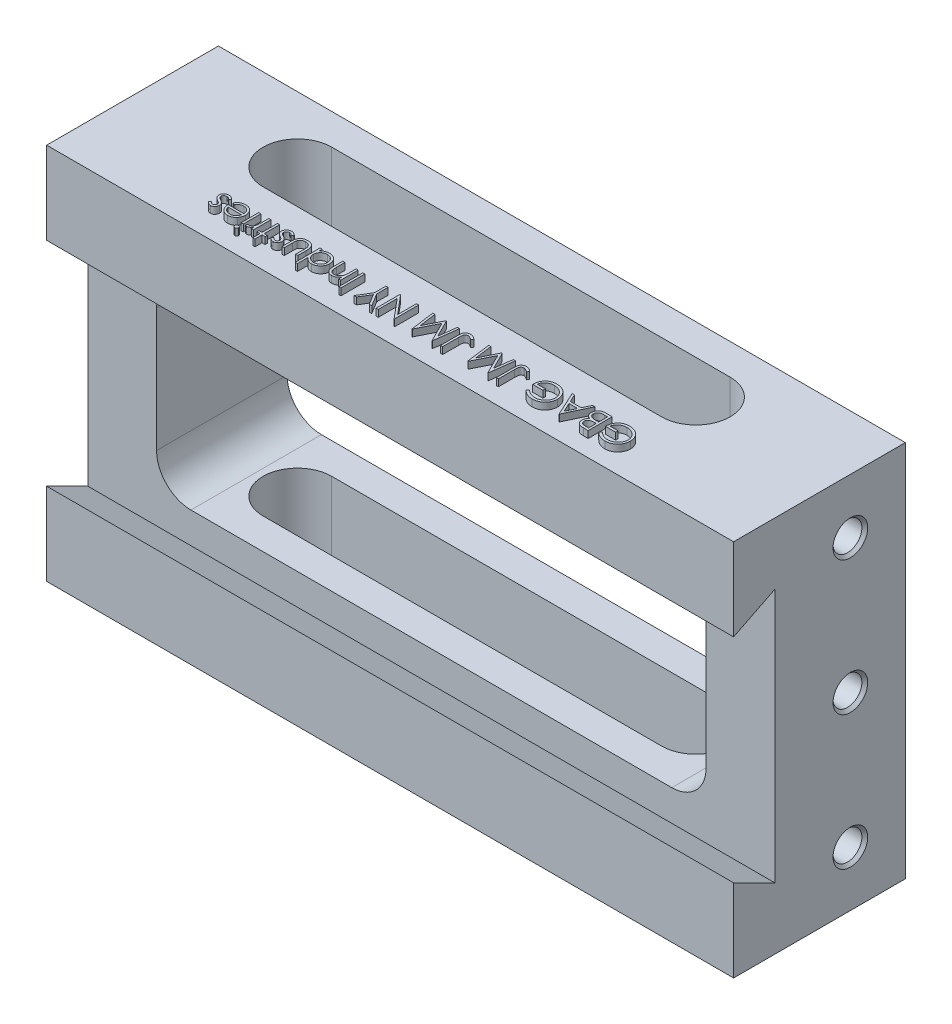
from build123d import *

# Parameters (mm, degrees)
SKETCH2_W                      = 100
SKETCH2_H                      = 55
BOSS_EXTRUDE1_DEPTH            = 25
CUT_EXTRUDE1_DEPTH             = 79.421935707
CUT_EXTRUDE1_DEPTH_BACK        = 79.421935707
CUT_EXTRUDE2_DEPTH             = 107.682941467
CUT_EXTRUDE2_DEPTH_BACK        = 107.682941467
M5X0_8_TAPPED_HOLE1_AT_2_COUNT = 2
M5X0_8_TAPPED_HOLE1_AT_2_PITCH = 19.5
M5X0_8_TAPPED_HOLE1_AT_3_COUNT = 2
M5X0_8_TAPPED_HOLE1_AT_3_PITCH = 39
SKETCH9_W                      = 0.314102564
SKETCH9_H                      = 3.5
SKETCH9_H_2                    = 2.557692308
BOSS_EXTRUDE2_DEPTH            = 1


with BuildPart() as part:
    # Sketch2 → Boss-Extrude1 (new body)
    with BuildSketch(Plane.XY):
        Rectangle(SKETCH2_W, SKETCH2_H)
        with BuildLine():
            Line((-35, -14), (35, -14))
            ThreePointArc((35, -14), (38.535533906, -12.535533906), (40, -9))
            Line((40, -9), (40, 9))
            ThreePointArc((40, 9), (38.535533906, 12.535533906), (35, 14))
            Line((35, 14), (-35, 14))
            ThreePointArc((-35, 14), (-38.535533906, 12.535533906), (-40, 9))
            Line((-40, 9), (-40, -9))
            ThreePointArc((-40, -9), (-38.535533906, -12.535533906), (-35, -14))
        make_face(mode=Mode.SUBTRACT)
    extrude(amount=BOSS_EXTRUDE1_DEPTH)

    # Sketch3 → Cut-Extrude1 (cut, two sides: drawn at the far end of the back side and taken through both)
    with BuildSketch(Plane.XZ.offset(27.5).offset(-CUT_EXTRUDE1_DEPTH_BACK)):
        with BuildLine():
            Line((-29, 14.5), (29, 14.5))
            ThreePointArc((29, 14.5), (34, 9.5), (29, 4.5))
            Line((29, 4.5), (-29, 4.5))
            ThreePointArc((-29, 4.5), (-34, 9.5), (-29, 14.5))
        make_face()
    extrude(amount=CUT_EXTRUDE1_DEPTH + CUT_EXTRUDE1_DEPTH_BACK, mode=Mode.SUBTRACT)

    # Sketch4 → Cut-Extrude2 (cut, two sides: drawn at the far end of the back side and taken through both)
    with BuildSketch(Plane(origin=(50, 0, 0), x_dir=(0, 0, -1), z_dir=(1, 0, 0)).offset(-CUT_EXTRUDE2_DEPTH_BACK)):
        Polygon((-25, -15.5), (-19, -18.5), (-19, 18.5), (-25, 15.5), align=None)
    extrude(amount=CUT_EXTRUDE2_DEPTH + CUT_EXTRUDE2_DEPTH_BACK, mode=Mode.SUBTRACT)

    # Sketch6 → M5x0.8 Tapped Hole1 (revolve, cut)
    with BuildSketch(Plane(origin=(-50, 19.5, 8), x_dir=(0, 0, 1), z_dir=(0, 1, 0))):
        Polygon((0, 0), (0, 8.4618073), (2.1, 7.2), (2.1, 0.425), (2.525, 0), align=None)
    m5x0_8_tapped_hole1 = revolve(axis=Axis((-56.35, 19.5, 8), (1, 0, 0)), mode=Mode.SUBTRACT)

    # M5x0.8 Tapped Hole1 at 2: M5x0.8 Tapped Hole1 ×2
    with Locations(*[(0, -i * M5X0_8_TAPPED_HOLE1_AT_2_PITCH, 0) for i in range(1, M5X0_8_TAPPED_HOLE1_AT_2_COUNT)]):
        add(m5x0_8_tapped_hole1, mode=Mode.SUBTRACT)

    # M5x0.8 Tapped Hole1 at 3: M5x0.8 Tapped Hole1 ×2
    with Locations(*[(0, -i * M5X0_8_TAPPED_HOLE1_AT_3_PITCH, 0) for i in range(1, M5X0_8_TAPPED_HOLE1_AT_3_COUNT)]):
        add(m5x0_8_tapped_hole1, mode=Mode.SUBTRACT)

    # Mirror1: M5x0.8 Tapped Hole1 across plane
    add(m5x0_8_tapped_hole1.mirror(Plane(origin=(0, 0, 0), x_dir=(0, 0, 1), z_dir=(1, 0, 0))), mode=Mode.SUBTRACT)

    # Mirror1 copy 1 sketch → Mirror1 copy 1 (revolve, cut)
    with BuildSketch(Plane(origin=(50, 0, 8), x_dir=(0, 0, 1), z_dir=(0, 1, 0))):
        Polygon((0, 0), (0, -8.4618073), (2.1, -7.2), (2.1, -0.425), (2.525, 0), align=None)
    revolve(axis=Axis((56.35, 0, 8), (1, 0, 0)), mode=Mode.SUBTRACT)

    # Mirror1 copy 2 sketch → Mirror1 copy 2 (revolve, cut)
    with BuildSketch(Plane(origin=(50, -19.5, 8), x_dir=(0, 0, 1), z_dir=(0, 1, 0))):
        Polygon((0, 0), (0, -8.4618073), (2.1, -7.2), (2.1, -0.425), (2.525, 0), align=None)
    revolve(axis=Axis((56.35, -19.5, 8), (1, 0, 0)), mode=Mode.SUBTRACT)

    # Sketch9 → Boss-Extrude2 (add)
    # profile 1 of 21: a face of its own
    with BuildSketch(Plane(origin=(0, 27.5, 0), x_dir=(1, 0, 0), z_dir=(0, 1, 0))):
        with BuildLine():
            Line((27.344718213, -21.975621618), (27.613948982, -21.720413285))
            add(Edge.make_bspline(
                [(27.613948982, -21.720413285), (27.662953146, -21.766181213), (27.75953279, -21.856382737), (27.916237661, -21.974723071), (28.079961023, -22.075308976), (28.249371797, -22.157947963), (28.421203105, -22.222186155), (28.592024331, -22.268633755), (28.760637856, -22.298505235), (28.872578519, -22.302014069), (28.927851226, -22.303746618)],
                knots=[0, 0, 0, 0, 1.091957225, 2.152079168, 3.193085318, 4.218301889, 5.218403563, 6.17723952, 7.099979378, 8, 8, 8, 8], degree=3))
            add(Edge.make_bspline(
                [(28.927851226, -22.303746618), (28.961765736, -22.303332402), (29.029506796, -22.302505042), (29.130131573, -22.291969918), (29.229687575, -22.276770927), (29.327831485, -22.255005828), (29.424953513, -22.226736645), (29.520837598, -22.192605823), (29.615298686, -22.151519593), (29.707839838, -22.104677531), (29.798012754, -22.053541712), (29.88282086, -21.996510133), (29.962617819, -21.935337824), (30.036839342, -21.869222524), (30.106502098, -21.799264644), (30.170330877, -21.724470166), (30.229721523, -21.645946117), (30.282452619, -21.562566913), (30.330113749, -21.476701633), (30.371384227, -21.389034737), (30.4069205, -21.300184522), (30.435316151, -21.2101009), (30.458145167, -21.118841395), (30.474303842, -21.026548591), (30.483379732, -20.932767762), (30.484952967, -20.869970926), (30.485743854, -20.838402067)],
                knots=[0, 0, 0, 0, 1.028307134, 2.053947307, 3.065600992, 4.082111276, 5.100671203, 6.132125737, 7.167228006, 8.222953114, 9.277225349, 10.309459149, 11.320441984, 12.324791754, 13.322338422, 14.312705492, 15.305176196, 16.306142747, 17.302479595, 18.282363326, 19.243345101, 20.20291386, 21.145121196, 22.094978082, 23.042318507, 24, 24, 24, 24], degree=3))
            add(Edge.make_bspline(
                [(30.485743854, -20.838402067), (30.48498091, -20.806133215), (30.483457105, -20.741683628), (30.47390469, -20.645460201), (30.455578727, -20.550862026), (30.433193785, -20.456996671), (30.40150851, -20.365062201), (30.364675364, -20.273712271), (30.320262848, -20.183795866), (30.269120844, -20.095939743), (30.21260344, -20.010442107), (30.150454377, -19.929228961), (30.082556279, -19.85324942), (30.010157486, -19.78139263), (29.932597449, -19.714112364), (29.849123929, -19.652219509), (29.760905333, -19.59475703), (29.667902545, -19.542356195), (29.571098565, -19.495548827), (29.471842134, -19.453924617), (29.369814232, -19.419645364), (29.265551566, -19.391707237), (29.159178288, -19.368806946), (29.050154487, -19.354074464), (28.939281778, -19.343383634), (28.864543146, -19.342601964), (28.826889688, -19.342208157)],
                knots=[0, 0, 0, 0, 0.935896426, 1.86923723, 2.799743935, 3.728471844, 4.66505513, 5.616527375, 6.583419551, 7.570341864, 8.562833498, 9.553750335, 10.533080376, 11.5155245, 12.510142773, 13.507781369, 14.526649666, 15.561487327, 16.601173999, 17.643331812, 18.680652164, 19.71969803, 20.772446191, 21.833473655, 22.9085001, 24, 24, 24, 24], degree=3))
            add(Edge.make_bspline(
                [(28.826889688, -19.342208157), (28.781511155, -19.34315634), (28.692403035, -19.345018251), (28.561419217, -19.359524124), (28.435606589, -19.382150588), (28.315374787, -19.415389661), (28.200287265, -19.457462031), (28.090769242, -19.5094909), (27.986515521, -19.570927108), (27.88798772, -19.640533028), (27.797490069, -19.718066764), (27.71523281, -19.801054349), (27.643626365, -19.890157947), (27.582203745, -19.985358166), (27.529336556, -20.085253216), (27.487165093, -20.191555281), (27.4545475, -20.303077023), (27.44120404, -20.380174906), (27.434461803, -20.419131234)],
                knots=[0, 0, 0, 0, 1.130234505, 2.219399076, 3.279128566, 4.311639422, 5.322903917, 6.328167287, 7.327698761, 8.334124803, 9.329374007, 10.292761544, 11.24113083, 12.171311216, 13.111441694, 14.052040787, 15.015727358, 16, 16, 16, 16], degree=3))
            Line((27.434461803, -20.419131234), (28.60112847, -20.419131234))
            Line((28.60112847, -20.419131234), (28.60112847, -20.778105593))
            Line((28.60112847, -20.778105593), (27.120359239, -20.778105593))
            add(Edge.make_bspline(
                [(27.120359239, -20.778105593), (27.122065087, -20.711198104), (27.125403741, -20.580248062), (27.148822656, -20.389277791), (27.186639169, -20.208906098), (27.23829948, -20.038943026), (27.305174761, -19.879629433), (27.386547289, -19.730803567), (27.48371941, -19.593426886), (27.593229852, -19.466377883), (27.71612981, -19.353048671), (27.84909843, -19.253442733), (27.992355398, -19.169540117), (28.145765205, -19.101279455), (28.308825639, -19.04800546), (28.481914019, -19.010233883), (28.664795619, -18.98760392), (28.790132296, -18.984712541), (28.854233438, -18.983233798)],
                knots=[0, 0, 0, 0, 1.140356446, 2.231883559, 3.274166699, 4.278491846, 5.25512956, 6.21435461, 7.1637429, 8.11826594, 9.068280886, 10.0076534, 10.945064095, 11.891975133, 12.864533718, 13.863980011, 14.907571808, 16, 16, 16, 16], degree=3))
            add(Edge.make_bspline(
                [(28.854233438, -18.983233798), (28.893743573, -18.983802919), (28.971670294, -18.984925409), (29.086761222, -18.992902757), (29.198678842, -19.005183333), (29.307406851, -19.023728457), (29.413345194, -19.046443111), (29.515964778, -19.07552983), (29.615656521, -19.109198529), (29.712574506, -19.147494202), (29.805839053, -19.191865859), (29.89586557, -19.241175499), (29.983151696, -19.295168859), (30.067102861, -19.354779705), (30.148156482, -19.419562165), (30.225789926, -19.489646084), (30.300437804, -19.564817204), (30.347198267, -19.618196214), (30.37075988, -19.645092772)],
                knots=[0, 0, 0, 0, 1.107784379, 2.184907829, 3.233506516, 4.263428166, 5.276301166, 6.270063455, 7.25232949, 8.225834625, 9.190232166, 10.146266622, 11.1027726, 12.066435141, 13.031522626, 14.010570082, 14.99756817, 16, 16, 16, 16], degree=3))
            add(Edge.make_bspline(
                [(30.37075988, -19.645092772), (30.404945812, -19.687763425), (30.472750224, -19.772396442), (30.560028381, -19.907996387), (30.634429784, -20.048398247), (30.694797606, -20.193992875), (30.741935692, -20.344644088), (30.775741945, -20.500159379), (30.795549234, -20.66073901), (30.798402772, -20.769404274), (30.799846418, -20.824379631)],
                knots=[0, 0, 0, 0, 1.023165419, 2.029347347, 3.013907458, 3.994755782, 4.975994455, 5.96558838, 6.970761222, 8, 8, 8, 8], degree=3))
            add(Edge.make_bspline(
                [(30.799846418, -20.824379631), (30.799312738, -20.865545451), (30.798252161, -20.947353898), (30.785447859, -21.068817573), (30.766967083, -21.188094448), (30.74019839, -21.305294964), (30.704977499, -21.419898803), (30.662678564, -21.532786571), (30.613134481, -21.643507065), (30.555318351, -21.751078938), (30.492386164, -21.855465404), (30.421619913, -21.953380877), (30.346950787, -22.046718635), (30.264801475, -22.132836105), (30.178250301, -22.214484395), (30.085144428, -22.289511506), (29.987011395, -22.359183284), (29.883058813, -22.422136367), (29.774935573, -22.478704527), (29.662874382, -22.528292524), (29.546916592, -22.569276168), (29.427929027, -22.604049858), (29.305011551, -22.629765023), (29.179056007, -22.648413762), (29.049405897, -22.661174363), (28.961769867, -22.662200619), (28.917334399, -22.662720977)],
                knots=[0, 0, 0, 0, 1.009025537, 2.005226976, 2.991671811, 3.967589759, 4.950148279, 5.929425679, 6.922109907, 7.921964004, 8.922507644, 9.908469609, 10.882248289, 11.851158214, 12.824245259, 13.798023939, 14.780666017, 15.773333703, 16.775582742, 17.771174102, 18.775387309, 19.789283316, 20.80873549, 21.851817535, 22.910773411, 24, 24, 24, 24], degree=3))
            add(Edge.make_bspline(
                [(28.917334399, -22.662720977), (28.88109589, -22.662142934), (28.809239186, -22.660996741), (28.702317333, -22.653010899), (28.597258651, -22.640493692), (28.493536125, -22.622990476), (28.391544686, -22.599836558), (28.290975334, -22.571618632), (28.192018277, -22.538947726), (28.094791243, -22.499953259), (27.998633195, -22.455701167), (27.903011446, -22.405887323), (27.808252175, -22.349662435), (27.7141912, -22.286858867), (27.620235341, -22.218555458), (27.527870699, -22.142798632), (27.434867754, -22.062575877), (27.37506594, -22.004893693), (27.344718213, -21.975621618)],
                knots=[0, 0, 0, 0, 0.985875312, 1.954874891, 2.915472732, 3.863573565, 4.815313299, 5.759461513, 6.704487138, 7.649063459, 8.607849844, 9.583336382, 10.581114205, 11.603942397, 12.659508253, 13.739925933, 14.853076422, 16, 16, 16, 16], degree=3))
        make_face()
    # profile 2 of 21: a face of its own
    with BuildSketch(Plane(origin=(0, 27.5, 0), x_dir=(1, 0, 0), z_dir=(0, 1, 0))):
        with BuildLine():
            Line((26.402410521, -22.572977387), (25.719517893, -22.572977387))
            add(Edge.make_bspline(
                [(25.719517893, -22.572977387), (25.686088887, -22.572804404), (25.621295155, -22.572469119), (25.527082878, -22.567148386), (25.438809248, -22.560074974), (25.356630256, -22.548209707), (25.280011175, -22.53590699), (25.20972985, -22.517849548), (25.145197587, -22.497904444), (25.067707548, -22.467216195), (24.979784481, -22.419556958), (24.885283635, -22.34887378), (24.803137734, -22.264130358), (24.733289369, -22.167558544), (24.67723457, -22.061318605), (24.637194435, -21.947696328), (24.611471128, -21.828603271), (24.608858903, -21.74695397), (24.607538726, -21.705689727)],
                knots=[0, 0, 0, 0, 1.00128172, 1.940733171, 2.826250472, 3.653024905, 4.427672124, 5.149348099, 5.824709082, 6.450061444, 7.643590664, 8.808605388, 9.972104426, 11.165284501, 12.367876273, 13.557044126, 14.765369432, 16, 16, 16, 16], degree=3))
            add(Edge.make_bspline(
                [(24.607538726, -21.705689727), (24.608617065, -21.667032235), (24.610736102, -21.591066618), (24.631437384, -21.48033059), (24.662685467, -21.37458761), (24.707778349, -21.274856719), (24.765275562, -21.182014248), (24.835229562, -21.097643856), (24.918175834, -21.023402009), (24.980452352, -20.982085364), (25.012086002, -20.961098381)],
                knots=[0, 0, 0, 0, 1.044356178, 2.052258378, 3.035953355, 4.020338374, 5.002448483, 5.980768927, 6.974322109, 8, 8, 8, 8], degree=3))
            add(Edge.make_bspline(
                [(25.012086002, -20.961098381), (24.972322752, -20.945840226), (24.896245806, -20.916647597), (24.791418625, -20.86483547), (24.701072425, -20.808913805), (24.624042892, -20.748472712), (24.559497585, -20.681538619), (24.501998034, -20.60987428), (24.453199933, -20.53098387), (24.411564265, -20.446576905), (24.378582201, -20.357100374), (24.355688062, -20.263223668), (24.341168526, -20.16601007), (24.339269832, -20.099938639), (24.338307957, -20.066466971)],
                knots=[0, 0, 0, 0, 1.272200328, 2.434034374, 3.488177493, 4.442517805, 5.351202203, 6.260825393, 7.183200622, 8.11705787, 9.069326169, 10.026320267, 11.000137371, 12, 12, 12, 12], degree=3))
            add(Edge.make_bspline(
                [(24.338307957, -20.066466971), (24.339284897, -20.032300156), (24.341207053, -19.965075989), (24.355385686, -19.866320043), (24.379399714, -19.77194808), (24.412452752, -19.68133192), (24.455539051, -19.595002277), (24.507591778, -19.512280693), (24.570066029, -19.434393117), (24.64041818, -19.360209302), (24.71891094, -19.292371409), (24.80540382, -19.234073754), (24.897680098, -19.183719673), (24.997003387, -19.143237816), (25.102668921, -19.111547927), (25.214701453, -19.089637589), (25.333037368, -19.074815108), (25.414248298, -19.073600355), (25.455896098, -19.072977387)],
                knots=[0, 0, 0, 0, 0.978522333, 1.925270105, 2.85076145, 3.763600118, 4.682725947, 5.609499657, 6.557784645, 7.537954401, 8.534920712, 9.522742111, 10.520247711, 11.5409147, 12.58930695, 13.675078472, 14.807699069, 16, 16, 16, 16], degree=3))
            Line((25.455896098, -19.072977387), (26.402410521, -19.072977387))
            Line((26.402410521, -19.072977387), (26.402410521, -22.572977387))
        make_face()
        with BuildLine():
            Line((26.088307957, -22.214003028), (26.088307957, -21.092208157))
            Line((26.088307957, -21.092208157), (25.877270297, -21.092208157))
            add(Edge.make_bspline(
                [(25.877270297, -21.092208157), (25.846421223, -21.092604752), (25.786814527, -21.093371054), (25.700265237, -21.095635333), (25.620127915, -21.101697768), (25.54612644, -21.108109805), (25.478756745, -21.117982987), (25.417793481, -21.130065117), (25.362688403, -21.142730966), (25.29917092, -21.164333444), (25.227131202, -21.195925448), (25.150872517, -21.246154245), (25.082236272, -21.304308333), (25.025615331, -21.373288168), (24.978476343, -21.447780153), (24.946739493, -21.528339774), (24.924611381, -21.612190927), (24.922641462, -21.670019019), (24.92164129, -21.699379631)],
                knots=[0, 0, 0, 0, 1.156584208, 2.234756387, 3.244705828, 4.168772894, 5.018724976, 5.795346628, 6.498686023, 7.135894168, 8.308330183, 9.43588092, 10.547699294, 11.667188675, 12.76860303, 13.837480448, 14.902040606, 16, 16, 16, 16], degree=3))
            add(Edge.make_bspline(
                [(24.92164129, -21.699379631), (24.92212909, -21.718816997), (24.923085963, -21.756945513), (24.932106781, -21.812496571), (24.944555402, -21.865359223), (24.965086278, -21.914108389), (24.989410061, -21.960455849), (25.02058734, -22.002937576), (25.056537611, -22.042704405), (25.098451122, -22.078690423), (25.146156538, -22.111237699), (25.201165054, -22.138331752), (25.261981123, -22.162409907), (25.32987295, -22.180661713), (25.403488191, -22.196507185), (25.483949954, -22.206499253), (25.570773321, -22.212918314), (25.630929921, -22.213633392), (25.662025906, -22.214003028)],
                knots=[0, 0, 0, 0, 0.911412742, 1.787835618, 2.63643285, 3.453173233, 4.262886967, 5.08783453, 5.918594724, 6.773969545, 7.67442701, 8.62112486, 9.645634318, 10.739428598, 11.916091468, 13.177237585, 14.540865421, 16, 16, 16, 16], degree=3))
            Line((25.662025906, -22.214003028), (26.088307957, -22.214003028))
        make_face(mode=Mode.SUBTRACT)
        with BuildLine():
            Line((26.088307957, -20.733233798), (26.088307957, -19.431951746))
            Line((26.088307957, -19.431951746), (25.640992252, -19.431951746))
            add(Edge.make_bspline(
                [(25.640992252, -19.431951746), (25.608976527, -19.432372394), (25.547270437, -19.433183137), (25.458109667, -19.435106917), (25.375910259, -19.442244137), (25.299987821, -19.449086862), (25.230693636, -19.460265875), (25.1673537, -19.471091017), (25.111414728, -19.487020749), (25.0459629, -19.508940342), (24.972755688, -19.543970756), (24.892809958, -19.595485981), (24.8223944, -19.658235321), (24.762651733, -19.730487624), (24.712978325, -19.808237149), (24.678614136, -19.89163692), (24.656348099, -19.977901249), (24.653725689, -20.036885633), (24.652410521, -20.066466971)],
                knots=[0, 0, 0, 0, 1.16016216, 2.236059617, 3.229676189, 4.14889023, 4.996733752, 5.772278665, 6.474820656, 7.101410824, 8.271817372, 9.403828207, 10.537358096, 11.673541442, 12.791884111, 13.865947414, 14.929748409, 16, 16, 16, 16], degree=3))
            add(Edge.make_bspline(
                [(24.652410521, -20.066466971), (24.652678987, -20.084963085), (24.653211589, -20.12165697), (24.661583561, -20.17553235), (24.673201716, -20.227978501), (24.690323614, -20.278283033), (24.711036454, -20.327312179), (24.738361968, -20.373470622), (24.769184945, -20.418723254), (24.816925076, -20.476606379), (24.887310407, -20.542492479), (24.98736564, -20.606193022), (25.100495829, -20.658397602), (25.182741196, -20.680467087), (25.225227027, -20.691867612)],
                knots=[0, 0, 0, 0, 0.723354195, 1.435040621, 2.129761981, 2.824182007, 3.512608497, 4.209435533, 4.920062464, 5.654614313, 7.143585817, 8.671381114, 10.280521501, 12, 12, 12, 12], degree=3))
            add(Edge.make_bspline(
                [(25.225227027, -20.691867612), (25.242256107, -20.695322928), (25.279178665, -20.702814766), (25.339386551, -20.710718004), (25.408352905, -20.717807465), (25.485782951, -20.722913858), (25.571984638, -20.728395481), (25.666930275, -20.730451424), (25.770686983, -20.732960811), (25.842679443, -20.733140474), (25.880074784, -20.733233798)],
                knots=[0, 0, 0, 0, 0.634452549, 1.375623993, 2.216454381, 3.166361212, 4.209414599, 5.370755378, 6.634280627, 8, 8, 8, 8], degree=3))
            Line((25.880074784, -20.733233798), (26.088307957, -20.733233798))
        make_face(mode=Mode.SUBTRACT)
    # profile 3 of 21: a face of its own
    with BuildSketch(Plane(origin=(0, 27.5, 0), x_dir=(1, 0, 0), z_dir=(0, 1, 0))):
        Polygon((22.184461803, -22.572977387), (20.569077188, -19.072977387), (20.910523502, -19.072977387), (21.427951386, -20.194772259), (23.014590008, -20.194772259), (23.54674145, -19.072977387), (23.889590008, -19.072977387), (22.229333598, -22.572977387), align=None)
        Polygon((22.210403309, -21.890785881), (22.844217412, -20.553746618), (21.59341613, -20.553746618), align=None, mode=Mode.SUBTRACT)
    # profile 4 of 21: a face of its own
    with BuildSketch(Plane(origin=(0, 27.5, 0), x_dir=(1, 0, 0), z_dir=(0, 1, 0))):
        with BuildLine():
            Line((16.754974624, -21.975621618), (17.024205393, -21.720413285))
            add(Edge.make_bspline(
                [(17.024205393, -21.720413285), (17.073209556, -21.766181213), (17.1697892, -21.856382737), (17.326494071, -21.974723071), (17.490217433, -22.075308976), (17.659628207, -22.157947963), (17.831459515, -22.222186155), (18.002280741, -22.268633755), (18.170894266, -22.298505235), (18.28283493, -22.302014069), (18.338107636, -22.303746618)],
                knots=[0, 0, 0, 0, 1.091957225, 2.152079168, 3.193085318, 4.218301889, 5.218403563, 6.17723952, 7.099979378, 8, 8, 8, 8], degree=3))
            add(Edge.make_bspline(
                [(18.338107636, -22.303746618), (18.372022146, -22.303332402), (18.439763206, -22.302505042), (18.540387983, -22.291969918), (18.639943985, -22.276770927), (18.738087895, -22.255005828), (18.835209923, -22.226736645), (18.931094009, -22.192605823), (19.025555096, -22.151519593), (19.118096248, -22.104677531), (19.208269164, -22.053541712), (19.293077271, -21.996510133), (19.372874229, -21.935337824), (19.447095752, -21.869222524), (19.516758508, -21.799264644), (19.580587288, -21.724470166), (19.639977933, -21.645946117), (19.69270903, -21.562566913), (19.740370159, -21.476701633), (19.781640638, -21.389034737), (19.81717691, -21.300184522), (19.845572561, -21.2101009), (19.868401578, -21.118841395), (19.884560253, -21.026548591), (19.893636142, -20.932767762), (19.895209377, -20.869970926), (19.896000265, -20.838402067)],
                knots=[0, 0, 0, 0, 1.028307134, 2.053947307, 3.065600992, 4.082111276, 5.100671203, 6.132125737, 7.167228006, 8.222953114, 9.277225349, 10.309459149, 11.320441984, 12.324791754, 13.322338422, 14.312705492, 15.305176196, 16.306142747, 17.302479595, 18.282363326, 19.243345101, 20.20291386, 21.145121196, 22.094978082, 23.042318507, 24, 24, 24, 24], degree=3))
            add(Edge.make_bspline(
                [(19.896000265, -20.838402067), (19.89523732, -20.806133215), (19.893713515, -20.741683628), (19.8841611, -20.645460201), (19.865835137, -20.550862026), (19.843450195, -20.456996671), (19.81176492, -20.365062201), (19.774931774, -20.273712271), (19.730519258, -20.183795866), (19.679377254, -20.095939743), (19.62285985, -20.010442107), (19.560710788, -19.929228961), (19.492812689, -19.85324942), (19.420413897, -19.78139263), (19.34285386, -19.714112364), (19.259380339, -19.652219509), (19.171161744, -19.59475703), (19.078158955, -19.542356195), (18.981354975, -19.495548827), (18.882098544, -19.453924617), (18.780070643, -19.419645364), (18.675807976, -19.391707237), (18.569434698, -19.368806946), (18.460410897, -19.354074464), (18.349538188, -19.343383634), (18.274799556, -19.342601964), (18.237146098, -19.342208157)],
                knots=[0, 0, 0, 0, 0.935896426, 1.86923723, 2.799743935, 3.728471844, 4.66505513, 5.616527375, 6.583419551, 7.570341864, 8.562833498, 9.553750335, 10.533080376, 11.5155245, 12.510142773, 13.507781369, 14.526649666, 15.561487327, 16.601173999, 17.643331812, 18.680652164, 19.71969803, 20.772446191, 21.833473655, 22.9085001, 24, 24, 24, 24], degree=3))
            add(Edge.make_bspline(
                [(18.237146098, -19.342208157), (18.191767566, -19.34315634), (18.102659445, -19.345018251), (17.971675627, -19.359524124), (17.845863, -19.382150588), (17.725631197, -19.415389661), (17.610543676, -19.457462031), (17.501025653, -19.5094909), (17.396771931, -19.570927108), (17.29824413, -19.640533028), (17.207746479, -19.718066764), (17.12548922, -19.801054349), (17.053882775, -19.890157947), (16.992460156, -19.985358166), (16.939592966, -20.085253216), (16.897421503, -20.191555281), (16.864803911, -20.303077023), (16.85146045, -20.380174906), (16.844718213, -20.419131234)],
                knots=[0, 0, 0, 0, 1.130234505, 2.219399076, 3.279128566, 4.311639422, 5.322903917, 6.328167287, 7.327698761, 8.334124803, 9.329374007, 10.292761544, 11.24113083, 12.171311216, 13.111441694, 14.052040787, 15.015727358, 16, 16, 16, 16], degree=3))
            Line((16.844718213, -20.419131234), (18.01138488, -20.419131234))
            Line((18.01138488, -20.419131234), (18.01138488, -20.778105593))
            Line((18.01138488, -20.778105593), (16.530615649, -20.778105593))
            add(Edge.make_bspline(
                [(16.530615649, -20.778105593), (16.532321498, -20.711198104), (16.535660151, -20.580248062), (16.559079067, -20.389277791), (16.596895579, -20.208906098), (16.648555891, -20.038943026), (16.715431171, -19.879629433), (16.796803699, -19.730803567), (16.893975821, -19.593426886), (17.003486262, -19.466377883), (17.12638622, -19.353048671), (17.25935484, -19.253442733), (17.402611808, -19.169540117), (17.556021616, -19.101279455), (17.719082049, -19.04800546), (17.892170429, -19.010233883), (18.07505203, -18.98760392), (18.200388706, -18.984712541), (18.264489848, -18.983233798)],
                knots=[0, 0, 0, 0, 1.140356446, 2.231883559, 3.274166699, 4.278491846, 5.25512956, 6.21435461, 7.1637429, 8.11826594, 9.068280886, 10.0076534, 10.945064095, 11.891975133, 12.864533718, 13.863980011, 14.907571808, 16, 16, 16, 16], degree=3))
            add(Edge.make_bspline(
                [(18.264489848, -18.983233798), (18.303999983, -18.983802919), (18.381926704, -18.984925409), (18.497017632, -18.992902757), (18.608935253, -19.005183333), (18.717663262, -19.023728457), (18.823601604, -19.046443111), (18.926221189, -19.07552983), (19.025912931, -19.109198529), (19.122830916, -19.147494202), (19.216095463, -19.191865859), (19.30612198, -19.241175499), (19.393408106, -19.295168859), (19.477359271, -19.354779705), (19.558412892, -19.419562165), (19.636046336, -19.489646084), (19.710694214, -19.564817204), (19.757454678, -19.618196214), (19.78101629, -19.645092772)],
                knots=[0, 0, 0, 0, 1.107784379, 2.184907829, 3.233506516, 4.263428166, 5.276301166, 6.270063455, 7.25232949, 8.225834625, 9.190232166, 10.146266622, 11.1027726, 12.066435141, 13.031522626, 14.010570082, 14.99756817, 16, 16, 16, 16], degree=3))
            add(Edge.make_bspline(
                [(19.78101629, -19.645092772), (19.815202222, -19.687763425), (19.883006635, -19.772396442), (19.970284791, -19.907996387), (20.044686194, -20.048398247), (20.105054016, -20.193992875), (20.152192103, -20.344644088), (20.185998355, -20.500159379), (20.205805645, -20.66073901), (20.208659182, -20.769404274), (20.210102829, -20.824379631)],
                knots=[0, 0, 0, 0, 1.023165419, 2.029347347, 3.013907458, 3.994755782, 4.975994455, 5.96558838, 6.970761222, 8, 8, 8, 8], degree=3))
            add(Edge.make_bspline(
                [(20.210102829, -20.824379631), (20.209569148, -20.865545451), (20.208508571, -20.947353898), (20.195704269, -21.068817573), (20.177223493, -21.188094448), (20.1504548, -21.305294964), (20.11523391, -21.419898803), (20.072934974, -21.532786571), (20.023390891, -21.643507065), (19.965574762, -21.751078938), (19.902642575, -21.855465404), (19.831876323, -21.953380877), (19.757207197, -22.046718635), (19.675057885, -22.132836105), (19.588506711, -22.214484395), (19.495400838, -22.289511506), (19.397267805, -22.359183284), (19.293315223, -22.422136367), (19.185191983, -22.478704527), (19.073130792, -22.528292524), (18.957173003, -22.569276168), (18.838185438, -22.604049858), (18.715267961, -22.629765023), (18.589312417, -22.648413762), (18.459662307, -22.661174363), (18.372026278, -22.662200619), (18.327590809, -22.662720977)],
                knots=[0, 0, 0, 0, 1.009025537, 2.005226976, 2.991671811, 3.967589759, 4.950148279, 5.929425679, 6.922109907, 7.921964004, 8.922507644, 9.908469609, 10.882248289, 11.851158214, 12.824245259, 13.798023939, 14.780666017, 15.773333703, 16.775582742, 17.771174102, 18.775387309, 19.789283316, 20.80873549, 21.851817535, 22.910773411, 24, 24, 24, 24], degree=3))
            add(Edge.make_bspline(
                [(18.327590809, -22.662720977), (18.291352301, -22.662142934), (18.219495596, -22.660996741), (18.112573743, -22.653010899), (18.007515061, -22.640493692), (17.903792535, -22.622990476), (17.801801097, -22.599836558), (17.701231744, -22.571618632), (17.602274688, -22.538947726), (17.505047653, -22.499953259), (17.408889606, -22.455701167), (17.313267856, -22.405887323), (17.218508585, -22.349662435), (17.124447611, -22.286858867), (17.030491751, -22.218555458), (16.938127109, -22.142798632), (16.845124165, -22.062575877), (16.78532235, -22.004893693), (16.754974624, -21.975621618)],
                knots=[0, 0, 0, 0, 0.985875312, 1.954874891, 2.915472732, 3.863573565, 4.815313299, 5.759461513, 6.704487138, 7.649063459, 8.607849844, 9.583336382, 10.581114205, 11.603942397, 12.659508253, 13.739925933, 14.853076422, 16, 16, 16, 16], degree=3))
        make_face()
    # profile 5 of 21: a face of its own
    with BuildSketch(Plane(origin=(0, 27.5, 0), x_dir=(1, 0, 0), z_dir=(0, 1, 0))):
        with BuildLine():
            Line((13.344718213, -22.572977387), (13.030615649, -22.572977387))
            Line((13.030615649, -22.572977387), (13.030615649, -20.209495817))
            add(Edge.make_bspline(
                [(13.030615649, -20.209495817), (13.030928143, -20.165790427), (13.03152817, -20.081870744), (13.034861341, -19.960999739), (13.040945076, -19.850386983), (13.050090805, -19.750329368), (13.06098675, -19.6606723), (13.074820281, -19.581284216), (13.091273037, -19.512131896), (13.116185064, -19.434521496), (13.156794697, -19.349102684), (13.219129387, -19.257678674), (13.294926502, -19.176830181), (13.383993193, -19.108040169), (13.484416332, -19.051255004), (13.596611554, -19.011573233), (13.718525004, -18.987115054), (13.80313174, -18.984553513), (13.846721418, -18.983233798)],
                knots=[0, 0, 0, 0, 1.23761369, 2.376369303, 3.423688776, 4.373947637, 5.221061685, 5.980504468, 6.65465141, 7.232267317, 8.286152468, 9.319580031, 10.354278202, 11.410653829, 12.495036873, 13.606623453, 14.766924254, 16, 16, 16, 16], degree=3))
            add(Edge.make_bspline(
                [(13.846721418, -18.983233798), (13.880913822, -18.98429874), (13.949244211, -18.986426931), (14.051234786, -19.004215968), (14.152301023, -19.032160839), (14.253948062, -19.0723297), (14.357451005, -19.126721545), (14.465467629, -19.196993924), (14.577818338, -19.285010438), (14.652027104, -19.35200914), (14.690872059, -19.387079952)],
                knots=[0, 0, 0, 0, 0.854547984, 1.707735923, 2.581180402, 3.47327429, 4.435225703, 5.500268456, 6.691502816, 8, 8, 8, 8], degree=3))
            Line((14.690872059, -19.387079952), (14.505775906, -19.656310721))
            add(Edge.make_bspline(
                [(14.505775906, -19.656310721), (14.462983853, -19.627011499), (14.382249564, -19.571733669), (14.264848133, -19.498351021), (14.158862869, -19.438734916), (14.090208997, -19.407249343), (14.0584602, -19.392688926)],
                knots=[0, 0, 0, 0, 1.196638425, 2.257656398, 3.194257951, 4, 4, 4, 4], degree=3))
            add(Edge.make_bspline(
                [(14.0584602, -19.392688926), (14.039223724, -19.38473065), (14.001627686, -19.369176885), (13.943311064, -19.354307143), (13.886151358, -19.343539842), (13.84793859, -19.342646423), (13.829193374, -19.342208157)],
                knots=[0, 0, 0, 0, 1.055403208, 2.062694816, 3.049657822, 4, 4, 4, 4], degree=3))
            add(Edge.make_bspline(
                [(13.829193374, -19.342208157), (13.8050094, -19.343216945), (13.757433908, -19.345201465), (13.687900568, -19.36320209), (13.62161459, -19.391018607), (13.560165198, -19.430873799), (13.504213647, -19.478369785), (13.457199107, -19.535040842), (13.419005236, -19.59879238), (13.394652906, -19.658624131), (13.380000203, -19.713657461), (13.370288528, -19.764007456), (13.363262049, -19.823106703), (13.355690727, -19.890580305), (13.351612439, -19.966892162), (13.346855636, -20.051690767), (13.345162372, -20.14522036), (13.344870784, -20.210431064), (13.344718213, -20.244551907)],
                knots=[0, 0, 0, 0, 0.997338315, 1.961996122, 2.948199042, 3.955162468, 4.975046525, 5.968827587, 6.982064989, 8.034375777, 8.624523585, 9.332616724, 10.150461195, 11.082242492, 12.136676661, 13.306224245, 14.590509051, 16, 16, 16, 16], degree=3))
            Line((13.344718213, -20.244551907), (13.344718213, -22.572977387))
        make_face()
    # profile 6 of 21: a face of its own
    with BuildSketch(Plane(origin=(0, 27.5, 0), x_dir=(1, 0, 0), z_dir=(0, 1, 0))):
        Polygon((12.312666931, -19.072977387), (11.850627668, -22.572977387), (11.805755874, -22.572977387), (10.360743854, -19.701182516), (8.919237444, -22.572977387), (8.873664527, -22.572977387), (8.408820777, -19.072977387), (8.724325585, -19.072977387), (9.059461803, -21.591406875), (10.322883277, -19.072977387), (10.393696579, -19.072977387), (11.662025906, -21.597015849), (11.996461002, -19.072977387), align=None)
    # profile 7 of 21: a face of its own
    with BuildSketch(Plane(origin=(0, 27.5, 0), x_dir=(1, 0, 0), z_dir=(0, 1, 0))):
        with BuildLine():
            Line((5.222923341, -22.572977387), (4.908820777, -22.572977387))
            Line((4.908820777, -22.572977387), (4.908820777, -20.209495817))
            add(Edge.make_bspline(
                [(4.908820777, -20.209495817), (4.909133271, -20.165790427), (4.909733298, -20.081870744), (4.913066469, -19.960999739), (4.919150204, -19.850386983), (4.928295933, -19.750329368), (4.939191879, -19.6606723), (4.953025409, -19.581284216), (4.969478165, -19.512131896), (4.994390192, -19.434521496), (5.034999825, -19.349102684), (5.097334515, -19.257678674), (5.17313163, -19.176830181), (5.262198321, -19.108040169), (5.36262146, -19.051255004), (5.474816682, -19.011573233), (5.596730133, -18.987115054), (5.681336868, -18.984553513), (5.724926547, -18.983233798)],
                knots=[0, 0, 0, 0, 1.23761369, 2.376369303, 3.423688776, 4.373947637, 5.221061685, 5.980504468, 6.65465141, 7.232267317, 8.286152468, 9.319580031, 10.354278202, 11.410653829, 12.495036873, 13.606623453, 14.766924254, 16, 16, 16, 16], degree=3))
            add(Edge.make_bspline(
                [(5.724926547, -18.983233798), (5.75911895, -18.98429874), (5.827449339, -18.986426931), (5.929439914, -19.004215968), (6.030506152, -19.032160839), (6.13215319, -19.0723297), (6.235656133, -19.126721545), (6.343672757, -19.196993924), (6.456023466, -19.285010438), (6.530232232, -19.35200914), (6.569077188, -19.387079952)],
                knots=[0, 0, 0, 0, 0.854547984, 1.707735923, 2.581180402, 3.47327429, 4.435225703, 5.500268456, 6.691502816, 8, 8, 8, 8], degree=3))
            Line((6.569077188, -19.387079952), (6.383981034, -19.656310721))
            add(Edge.make_bspline(
                [(6.383981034, -19.656310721), (6.341188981, -19.627011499), (6.260454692, -19.571733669), (6.143053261, -19.498351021), (6.037067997, -19.438734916), (5.968414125, -19.407249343), (5.936665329, -19.392688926)],
                knots=[0, 0, 0, 0, 1.196638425, 2.257656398, 3.194257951, 4, 4, 4, 4], degree=3))
            add(Edge.make_bspline(
                [(5.936665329, -19.392688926), (5.917428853, -19.38473065), (5.879832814, -19.369176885), (5.821516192, -19.354307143), (5.764356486, -19.343539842), (5.726143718, -19.342646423), (5.707398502, -19.342208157)],
                knots=[0, 0, 0, 0, 1.055403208, 2.062694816, 3.049657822, 4, 4, 4, 4], degree=3))
            add(Edge.make_bspline(
                [(5.707398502, -19.342208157), (5.683214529, -19.343216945), (5.635639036, -19.345201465), (5.566105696, -19.36320209), (5.499819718, -19.391018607), (5.438370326, -19.430873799), (5.382418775, -19.478369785), (5.335404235, -19.535040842), (5.297210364, -19.59879238), (5.272858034, -19.658624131), (5.258205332, -19.713657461), (5.248493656, -19.764007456), (5.241467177, -19.823106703), (5.233895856, -19.890580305), (5.229817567, -19.966892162), (5.225060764, -20.051690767), (5.2233675, -20.14522036), (5.223075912, -20.210431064), (5.222923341, -20.244551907)],
                knots=[0, 0, 0, 0, 0.997338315, 1.961996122, 2.948199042, 3.955162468, 4.975046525, 5.968827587, 6.982064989, 8.034375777, 8.624523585, 9.332616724, 10.150461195, 11.082242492, 12.136676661, 13.306224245, 14.590509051, 16, 16, 16, 16], degree=3))
            Line((5.222923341, -20.244551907), (5.222923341, -22.572977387))
        make_face()
    # profile 8 of 21: a face of its own
    with BuildSketch(Plane(origin=(0, 27.5, 0), x_dir=(1, 0, 0), z_dir=(0, 1, 0))):
        Polygon((4.190872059, -19.072977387), (3.728832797, -22.572977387), (3.683961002, -22.572977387), (2.238948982, -19.701182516), (0.797442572, -22.572977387), (0.751869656, -22.572977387), (0.287025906, -19.072977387), (0.602530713, -19.072977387), (0.937666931, -21.591406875), (2.201088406, -19.072977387), (2.271901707, -19.072977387), (3.540231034, -21.597015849), (3.87466613, -19.072977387), align=None)
    # profile 9 of 21: a face of its own
    with BuildSketch(Plane(origin=(0, 27.5, 0), x_dir=(1, 0, 0), z_dir=(0, 1, 0))):
        Polygon((-1.777076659, -19.072977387), (-1.777076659, -22.572977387), (-1.842982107, -22.572977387), (-4.155281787, -19.818269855), (-4.155281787, -22.572977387), (-4.469384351, -22.572977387), (-4.469384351, -19.072977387), (-4.397869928, -19.072977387), (-2.091179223, -21.821374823), (-2.091179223, -19.072977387), align=None)
    # profile 10 of 21: a face of its own
    with BuildSketch(Plane(origin=(0, 27.5, 0), x_dir=(1, 0, 0), z_dir=(0, 1, 0))):
        Polygon((-5.097589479, -22.572977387), (-5.45726496, -22.572977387), (-6.377136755, -21.069071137), (-7.295606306, -22.572977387), (-7.655281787, -22.572977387), (-6.533486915, -20.736739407), (-6.533486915, -19.072977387), (-6.219384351, -19.072977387), (-6.219384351, -20.736739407), align=None)
    # profile 11 of 21: a face of its own
    with BuildSketch(Plane(origin=(0, 27.5, 0), x_dir=(1, 0, 0), z_dir=(0, 1, 0))):
        with Locations((-9.741820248, -20.822977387)):
            Rectangle(SKETCH9_W, SKETCH9_H)
    # profile 12 of 21: a face of its own
    with BuildSketch(Plane(origin=(0, 27.5, 0), x_dir=(1, 0, 0), z_dir=(0, 1, 0))):
        with BuildLine():
            Line((-10.571948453, -21.630669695), (-10.886051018, -21.630669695))
            Line((-10.886051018, -21.630669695), (-10.886051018, -21.169331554))
            add(Edge.make_bspline(
                [(-10.886051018, -21.169331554), (-10.919530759, -21.211236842), (-10.984397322, -21.292427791), (-11.093533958, -21.398299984), (-11.207330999, -21.487143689), (-11.327636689, -21.557095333), (-11.453213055, -21.609999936), (-11.583703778, -21.648150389), (-11.71981514, -21.671039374), (-11.812380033, -21.674029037), (-11.859208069, -21.67554149)],
                knots=[0, 0, 0, 0, 1.127869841, 2.185233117, 3.191641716, 4.159226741, 5.10472073, 6.052603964, 7.014823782, 8, 8, 8, 8], degree=3))
            add(Edge.make_bspline(
                [(-11.859208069, -21.67554149), (-11.906561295, -21.673894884), (-11.999289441, -21.670670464), (-12.133815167, -21.642259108), (-12.260337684, -21.597297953), (-12.377165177, -21.534107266), (-12.482500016, -21.455651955), (-12.573843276, -21.363623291), (-12.650658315, -21.259129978), (-12.701928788, -21.161321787), (-12.735089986, -21.074443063), (-12.756882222, -21.000133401), (-12.774512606, -20.917309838), (-12.790310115, -20.82617715), (-12.800848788, -20.726369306), (-12.809202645, -20.618124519), (-12.815177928, -20.501461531), (-12.815415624, -20.420775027), (-12.815538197, -20.379167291)],
                knots=[0, 0, 0, 0, 1.235764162, 2.419900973, 3.574701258, 4.732869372, 5.875730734, 6.993815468, 8.107424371, 9.251605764, 9.866123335, 10.534503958, 11.272175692, 12.077112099, 12.949509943, 13.89253218, 14.913238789, 16, 16, 16, 16], degree=3))
            Line((-12.815538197, -20.379167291), (-12.815538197, -19.072977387))
            Line((-12.815538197, -19.072977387), (-12.501435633, -19.072977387))
            Line((-12.501435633, -19.072977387), (-12.501435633, -20.276102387))
            add(Edge.make_bspline(
                [(-12.501435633, -20.276102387), (-12.501243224, -20.310924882), (-12.50087518, -20.377534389), (-12.499699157, -20.472902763), (-12.496930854, -20.559158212), (-12.492880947, -20.636548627), (-12.487212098, -20.704790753), (-12.481143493, -20.764230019), (-12.473783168, -20.814339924), (-12.467219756, -20.844504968), (-12.464276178, -20.858033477)],
                knots=[0, 0, 0, 0, 1.430803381, 2.736883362, 3.918614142, 4.976458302, 5.92063272, 6.731858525, 7.431260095, 8, 8, 8, 8], degree=3))
            add(Edge.make_bspline(
                [(-12.464276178, -20.858033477), (-12.45370339, -20.897773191), (-12.433408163, -20.974056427), (-12.382238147, -21.077351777), (-12.319120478, -21.166008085), (-12.240919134, -21.238202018), (-12.149734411, -21.294403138), (-12.045414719, -21.333368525), (-11.929039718, -21.357747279), (-11.847184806, -21.36017405), (-11.804520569, -21.361438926)],
                knots=[0, 0, 0, 0, 1.084232, 2.08126119, 3.027460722, 3.945137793, 4.874029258, 5.839697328, 6.874011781, 8, 8, 8, 8], degree=3))
            add(Edge.make_bspline(
                [(-11.804520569, -21.361438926), (-11.77925055, -21.360969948), (-11.729241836, -21.360041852), (-11.655125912, -21.350488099), (-11.58300682, -21.33539915), (-11.513077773, -21.313111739), (-11.445197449, -21.286013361), (-11.379084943, -21.252762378), (-11.315664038, -21.212542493), (-11.254042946, -21.167335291), (-11.196768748, -21.116991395), (-11.142716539, -21.064637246), (-11.095224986, -21.008080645), (-11.052115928, -20.949321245), (-11.014948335, -20.887178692), (-10.982492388, -20.822317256), (-10.954957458, -20.75463434), (-10.941274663, -20.707659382), (-10.934428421, -20.684155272)],
                knots=[0, 0, 0, 0, 1.023939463, 2.026349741, 3.024227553, 4.007104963, 4.997624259, 5.984875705, 7.002218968, 8.038748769, 9.079772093, 10.091408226, 11.086177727, 12.069739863, 13.043026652, 14.017557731, 15.008077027, 16, 16, 16, 16], degree=3))
            add(Edge.make_bspline(
                [(-10.934428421, -20.684155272), (-10.930488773, -20.666900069), (-10.921912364, -20.629336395), (-10.912649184, -20.567691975), (-10.904241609, -20.496382), (-10.89720465, -20.415489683), (-10.892899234, -20.324731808), (-10.888204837, -20.22449597), (-10.886495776, -20.114382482), (-10.886203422, -20.037720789), (-10.886051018, -19.997757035)],
                knots=[0, 0, 0, 0, 0.615963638, 1.340920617, 2.168419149, 3.115676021, 4.16674242, 5.331190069, 6.6087489, 8, 8, 8, 8], degree=3))
            Line((-10.886051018, -19.997757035), (-10.886051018, -19.072977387))
            Line((-10.886051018, -19.072977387), (-10.571948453, -19.072977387))
            Line((-10.571948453, -19.072977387), (-10.571948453, -21.630669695))
        make_face()
    # profile 13 of 21: a face of its own
    with BuildSketch(Plane(origin=(0, 27.5, 0), x_dir=(1, 0, 0), z_dir=(0, 1, 0))):
        with BuildLine():
            Line((-16.136051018, -22.662720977), (-16.136051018, -19.072977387))
            Line((-16.136051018, -19.072977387), (-15.821948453, -19.072977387))
            Line((-15.821948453, -19.072977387), (-15.821948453, -19.51538524))
            add(Edge.make_bspline(
                [(-15.821948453, -19.51538524), (-15.786481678, -19.475400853), (-15.717164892, -19.397254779), (-15.602501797, -19.294533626), (-15.479954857, -19.210666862), (-15.351611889, -19.142592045), (-15.216479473, -19.091275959), (-15.075351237, -19.055124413), (-14.928337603, -19.031607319), (-14.828082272, -19.029283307), (-14.777276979, -19.028105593)],
                knots=[0, 0, 0, 0, 1.074235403, 2.099501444, 3.086304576, 4.053325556, 5.01427503, 5.985443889, 6.979105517, 8, 8, 8, 8], degree=3))
            add(Edge.make_bspline(
                [(-14.777276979, -19.028105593), (-14.732108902, -19.029331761), (-14.643035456, -19.03174982), (-14.512008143, -19.05051505), (-14.385909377, -19.080634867), (-14.264658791, -19.122575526), (-14.149077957, -19.177921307), (-14.038515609, -19.244897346), (-13.932713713, -19.323873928), (-13.8336844, -19.414512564), (-13.742376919, -19.512854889), (-13.662492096, -19.618051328), (-13.594787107, -19.728657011), (-13.539145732, -19.844640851), (-13.496087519, -19.965918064), (-13.466130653, -20.092405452), (-13.447385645, -20.223892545), (-13.444968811, -20.31343245), (-13.443743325, -20.358834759)],
                knots=[0, 0, 0, 0, 1.034036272, 2.039165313, 3.024406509, 3.999331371, 4.971254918, 5.953351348, 6.95522652, 7.989525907, 9.023492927, 10.024309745, 11.009187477, 11.988246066, 12.964946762, 13.950187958, 14.960617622, 16, 16, 16, 16], degree=3))
            add(Edge.make_bspline(
                [(-13.443743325, -20.358834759), (-13.444995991, -20.403298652), (-13.447472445, -20.49120137), (-13.465930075, -20.620477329), (-13.496944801, -20.745005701), (-13.54055297, -20.864325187), (-13.596223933, -20.978916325), (-13.665093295, -21.087882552), (-13.744949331, -21.192890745), (-13.837232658, -21.290573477), (-13.937150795, -21.380476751), (-14.043544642, -21.459645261), (-14.155087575, -21.526449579), (-14.272003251, -21.580754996), (-14.393463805, -21.623909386), (-14.520391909, -21.653992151), (-14.652210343, -21.671676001), (-14.741699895, -21.674240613), (-14.787092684, -21.67554149)],
                knots=[0, 0, 0, 0, 1.02050356, 2.017480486, 2.990790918, 3.96161403, 4.928589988, 5.909588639, 6.91611943, 7.952353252, 8.989586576, 9.99823133, 10.991940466, 11.968822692, 12.952985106, 13.945868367, 14.958059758, 16, 16, 16, 16], degree=3))
            add(Edge.make_bspline(
                [(-14.787092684, -21.67554149), (-14.83931741, -21.674001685), (-14.941828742, -21.67097922), (-15.091769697, -21.644858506), (-15.234114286, -21.603048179), (-15.368857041, -21.543658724), (-15.494815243, -21.466260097), (-15.613672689, -21.373180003), (-15.72360822, -21.262078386), (-15.788668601, -21.178453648), (-15.821948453, -21.135677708)],
                knots=[0, 0, 0, 0, 1.03083325, 2.023411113, 2.996083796, 3.9549903, 4.922369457, 5.908572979, 6.930187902, 8, 8, 8, 8], degree=3))
            Line((-15.821948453, -21.135677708), (-15.821948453, -22.662720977))
            Line((-15.821948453, -22.662720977), (-16.136051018, -22.662720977))
        make_face()
        with BuildLine():
            add(Edge.make_bspline(
                [(-14.791299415, -21.361438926), (-14.745386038, -21.359803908), (-14.654760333, -21.356576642), (-14.521702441, -21.331423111), (-14.394441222, -21.289463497), (-14.273183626, -21.232409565), (-14.161277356, -21.159325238), (-14.059605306, -21.07315315), (-13.970923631, -20.972837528), (-13.89594078, -20.860683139), (-13.833691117, -20.741169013), (-13.790734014, -20.61532426), (-13.762201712, -20.486550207), (-13.759301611, -20.399183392), (-13.757845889, -20.35532915)],
                knots=[0, 0, 0, 0, 1.031179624, 2.035384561, 3.030098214, 4.035455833, 5.037557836, 6.024646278, 7.02156144, 8.035264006, 9.049836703, 10.039645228, 11.015989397, 12, 12, 12, 12], degree=3))
            add(Edge.make_bspline(
                [(-13.757845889, -20.35532915), (-13.759735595, -20.311747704), (-13.7635076, -20.224755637), (-13.78985746, -20.095784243), (-13.836109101, -19.970760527), (-13.896997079, -19.849705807), (-13.973160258, -19.736714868), (-14.061666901, -19.634546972), (-14.163854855, -19.547046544), (-14.276746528, -19.473755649), (-14.397192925, -19.414799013), (-14.523901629, -19.373216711), (-14.654664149, -19.34696201), (-14.743734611, -19.343798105), (-14.788494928, -19.342208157)],
                knots=[0, 0, 0, 0, 0.979235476, 1.954632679, 2.943119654, 3.967171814, 4.992637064, 5.997548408, 6.995574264, 8.005058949, 9.015076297, 9.999929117, 10.994910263, 12, 12, 12, 12], degree=3))
            add(Edge.make_bspline(
                [(-14.788494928, -19.342208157), (-14.833940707, -19.343862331), (-14.924097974, -19.347143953), (-15.057615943, -19.372470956), (-15.186948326, -19.414951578), (-15.311041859, -19.472797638), (-15.426449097, -19.544512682), (-15.529546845, -19.628843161), (-15.618613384, -19.72541732), (-15.691945, -19.833658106), (-15.75053597, -19.951013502), (-15.792022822, -20.076360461), (-15.817220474, -20.208954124), (-15.820350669, -20.299828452), (-15.821948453, -20.346214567)],
                knots=[0, 0, 0, 0, 1.017730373, 2.019016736, 3.032373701, 4.060729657, 5.079187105, 6.068726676, 7.03591854, 8.011858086, 8.988317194, 9.965225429, 10.961364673, 12, 12, 12, 12], degree=3))
            add(Edge.make_bspline(
                [(-15.821948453, -20.346214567), (-15.820988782, -20.381552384), (-15.819099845, -20.45110839), (-15.804669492, -20.553236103), (-15.781713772, -20.650969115), (-15.749370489, -20.744414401), (-15.706868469, -20.833039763), (-15.655661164, -20.917539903), (-15.594698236, -20.997127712), (-15.525834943, -21.0717024), (-15.449607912, -21.139381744), (-15.368550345, -21.19903375), (-15.28286618, -21.249515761), (-15.192615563, -21.289914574), (-15.098493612, -21.322826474), (-14.999598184, -21.344564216), (-14.896925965, -21.359538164), (-14.826878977, -21.360798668), (-14.791299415, -21.361438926)],
                knots=[0, 0, 0, 0, 1.050062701, 2.066855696, 3.059271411, 4.030305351, 4.999747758, 5.975466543, 6.961907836, 7.974539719, 8.98812422, 9.98710676, 10.961662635, 11.93785114, 12.922015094, 13.919620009, 14.94329489, 16, 16, 16, 16], degree=3))
        make_face(mode=Mode.SUBTRACT)
    # profile 14 of 21: a face of its own
    with BuildSketch(Plane(origin=(0, 27.5, 0), x_dir=(1, 0, 0), z_dir=(0, 1, 0))):
        with BuildLine():
            Line((-16.809127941, -21.630669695), (-17.123230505, -21.630669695))
            Line((-17.123230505, -21.630669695), (-17.123230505, -20.444371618))
            add(Edge.make_bspline(
                [(-17.123230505, -20.444371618), (-17.12337241, -20.409548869), (-17.123643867, -20.342934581), (-17.125484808, -20.247079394), (-17.129814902, -20.159662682), (-17.135228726, -20.080633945), (-17.142190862, -20.010006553), (-17.150474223, -19.948027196), (-17.159732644, -19.893993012), (-17.168795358, -19.861449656), (-17.173010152, -19.846314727)],
                knots=[0, 0, 0, 0, 1.388932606, 2.656963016, 3.823490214, 4.879454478, 5.816252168, 6.653371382, 7.373723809, 8, 8, 8, 8], degree=3))
            add(Edge.make_bspline(
                [(-17.173010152, -19.846314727), (-17.179771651, -19.827291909), (-17.19315408, -19.789641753), (-17.217426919, -19.735251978), (-17.247457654, -19.68487956), (-17.280308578, -19.636564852), (-17.318241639, -19.591803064), (-17.360702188, -19.550301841), (-17.40693656, -19.511577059), (-17.474660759, -19.464871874), (-17.567240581, -19.415444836), (-17.688517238, -19.372202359), (-17.820254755, -19.346738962), (-17.911412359, -19.343746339), (-17.958266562, -19.342208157)],
                knots=[0, 0, 0, 0, 0.725930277, 1.436768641, 2.137297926, 2.832005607, 3.535753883, 4.242956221, 4.964984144, 5.701683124, 7.198126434, 8.723945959, 10.316137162, 12, 12, 12, 12], degree=3))
            add(Edge.make_bspline(
                [(-17.958266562, -19.342208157), (-18.005126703, -19.343740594), (-18.095562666, -19.346698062), (-18.225923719, -19.37181791), (-18.345308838, -19.41279887), (-18.452324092, -19.470805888), (-18.546297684, -19.541523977), (-18.624600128, -19.624538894), (-18.689207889, -19.717186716), (-18.717417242, -19.786311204), (-18.731603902, -19.821074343)],
                knots=[0, 0, 0, 0, 1.157091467, 2.233085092, 3.266839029, 4.264239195, 5.228693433, 6.160074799, 7.074690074, 8, 8, 8, 8], degree=3))
            add(Edge.make_bspline(
                [(-18.731603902, -19.821074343), (-18.735801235, -19.835040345), (-18.745080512, -19.865915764), (-18.754979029, -19.918301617), (-18.764264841, -19.980712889), (-18.7704556, -20.053805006), (-18.777521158, -20.136933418), (-18.779960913, -20.230528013), (-18.78344501, -20.334037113), (-18.783472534, -20.406506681), (-18.783486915, -20.444371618)],
                knots=[0, 0, 0, 0, 0.557560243, 1.232629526, 2.036798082, 2.970922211, 4.03790722, 5.227863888, 6.551574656, 8, 8, 8, 8], degree=3))
            Line((-18.783486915, -20.444371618), (-18.783486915, -21.630669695))
            Line((-18.783486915, -21.630669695), (-19.097589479, -21.630669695))
            Line((-19.097589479, -21.630669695), (-19.097589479, -20.385477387))
            add(Edge.make_bspline(
                [(-19.097589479, -20.385477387), (-19.097146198, -20.343170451), (-19.096286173, -20.261089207), (-19.090800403, -20.141801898), (-19.081256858, -20.030419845), (-19.067145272, -19.927284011), (-19.050025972, -19.832369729), (-19.028378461, -19.745647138), (-19.002392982, -19.666995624), (-18.973070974, -19.595267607), (-18.938516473, -19.530171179), (-18.901513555, -19.468733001), (-18.859907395, -19.411155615), (-18.814529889, -19.356912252), (-18.764067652, -19.307319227), (-18.711155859, -19.259833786), (-18.653210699, -19.217385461), (-18.592184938, -19.177713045), (-18.526540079, -19.142506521), (-18.456840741, -19.112043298), (-18.383160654, -19.085575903), (-18.305384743, -19.065123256), (-18.223558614, -19.047868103), (-18.137786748, -19.036383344), (-18.047905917, -19.029050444), (-17.986794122, -19.028425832), (-17.955462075, -19.028105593)],
                knots=[0, 0, 0, 0, 1.493120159, 2.896857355, 4.213387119, 5.437035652, 6.569467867, 7.615715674, 8.588612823, 9.490833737, 10.346735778, 11.186995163, 12.020221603, 12.851363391, 13.679553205, 14.515225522, 15.358192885, 16.211587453, 17.082499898, 17.983626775, 18.894104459, 19.842498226, 20.819547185, 21.843713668, 22.894470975, 24, 24, 24, 24], degree=3))
            add(Edge.make_bspline(
                [(-17.955462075, -19.028105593), (-17.924365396, -19.028444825), (-17.863257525, -19.029111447), (-17.773588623, -19.03625998), (-17.687631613, -19.048044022), (-17.605741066, -19.064984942), (-17.527586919, -19.085740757), (-17.453548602, -19.111857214), (-17.383532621, -19.142680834), (-17.31738833, -19.177745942), (-17.255335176, -19.217241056), (-17.197512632, -19.260709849), (-17.142889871, -19.307018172), (-17.092983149, -19.357745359), (-17.047426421, -19.412511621), (-17.006022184, -19.471070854), (-16.968062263, -19.532761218), (-16.933710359, -19.598825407), (-16.904198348, -19.671397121), (-16.878143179, -19.751694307), (-16.856832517, -19.840596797), (-16.839490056, -19.938028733), (-16.825538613, -20.043523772), (-16.815852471, -20.157692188), (-16.81043664, -20.28025588), (-16.809573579, -20.36490577), (-16.809127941, -20.408614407)],
                knots=[0, 0, 0, 0, 1.083759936, 2.129689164, 3.133164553, 4.10615121, 5.04285688, 5.949793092, 6.839814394, 7.707177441, 8.556916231, 9.400895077, 10.227072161, 11.05083587, 11.877976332, 12.707560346, 13.548664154, 14.401248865, 15.299878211, 16.27626931, 17.341250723, 18.483766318, 19.724630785, 21.049282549, 22.476408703, 24, 24, 24, 24], degree=3))
            Line((-16.809127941, -20.408614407), (-16.809127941, -21.630669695))
        make_face()
    # profile 15 of 21: a face of its own
    with BuildSketch(Plane(origin=(0, 27.5, 0), x_dir=(1, 0, 0), z_dir=(0, 1, 0))):
        with BuildLine():
            Line((-21.027076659, -21.311659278), (-20.813935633, -21.092208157))
            add(Edge.make_bspline(
                [(-20.813935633, -21.092208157), (-20.795548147, -21.113525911), (-20.760099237, -21.154624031), (-20.703827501, -21.209499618), (-20.64779174, -21.255967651), (-20.592287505, -21.29420289), (-20.537211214, -21.324294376), (-20.482092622, -21.345547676), (-20.427082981, -21.35889042), (-20.390293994, -21.360599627), (-20.372228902, -21.361438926)],
                knots=[0, 0, 0, 0, 1.265880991, 2.440469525, 3.530740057, 4.536711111, 5.468008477, 6.34654737, 7.188078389, 8, 8, 8, 8], degree=3))
            add(Edge.make_bspline(
                [(-20.372228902, -21.361438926), (-20.350098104, -21.360350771), (-20.306547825, -21.358209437), (-20.244192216, -21.337353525), (-20.187012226, -21.304428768), (-20.136409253, -21.259536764), (-20.0941599, -21.206337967), (-20.062493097, -21.147355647), (-20.043543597, -21.083535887), (-20.041124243, -21.039515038), (-20.039897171, -21.017188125)],
                knots=[0, 0, 0, 0, 0.999905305, 1.967672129, 2.944835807, 3.972828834, 5.013019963, 6.007753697, 6.989553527, 8, 8, 8, 8], degree=3))
            add(Edge.make_bspline(
                [(-20.039897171, -21.017188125), (-20.041007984, -20.99697608), (-20.043226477, -20.95660897), (-20.060473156, -20.897060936), (-20.087939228, -20.839003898), (-20.113609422, -20.803440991), (-20.126836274, -20.785116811)],
                knots=[0, 0, 0, 0, 0.960159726, 1.917612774, 2.927026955, 4, 4, 4, 4], degree=3))
            add(Edge.make_bspline(
                [(-20.126836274, -20.785116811), (-20.134840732, -20.775375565), (-20.151980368, -20.754517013), (-20.183068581, -20.724832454), (-20.219895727, -20.693793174), (-20.262811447, -20.661609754), (-20.311902, -20.628248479), (-20.366447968, -20.593142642), (-20.427123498, -20.557319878), (-20.469854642, -20.533767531), (-20.492120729, -20.521495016)],
                knots=[0, 0, 0, 0, 0.667332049, 1.428932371, 2.272176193, 3.217953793, 4.268659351, 5.415594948, 6.6533338, 8, 8, 8, 8], degree=3))
            add(Edge.make_bspline(
                [(-20.492120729, -20.521495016), (-20.519339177, -20.506256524), (-20.571916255, -20.476820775), (-20.646543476, -20.431024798), (-20.71467178, -20.385812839), (-20.775360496, -20.340151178), (-20.830032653, -20.295918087), (-20.877809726, -20.251890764), (-20.918839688, -20.207952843), (-20.941788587, -20.177213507), (-20.952757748, -20.162520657)],
                knots=[0, 0, 0, 0, 1.271974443, 2.457035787, 3.569878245, 4.604907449, 5.553098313, 6.436573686, 7.252710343, 8, 8, 8, 8], degree=3))
            add(Edge.make_bspline(
                [(-20.952757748, -20.162520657), (-20.971086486, -20.132896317), (-21.007634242, -20.073824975), (-21.043885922, -19.976011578), (-21.067714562, -19.873401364), (-21.070518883, -19.802984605), (-21.071948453, -19.767087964)],
                knots=[0, 0, 0, 0, 0.995678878, 1.985397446, 2.973007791, 4, 4, 4, 4], degree=3))
            add(Edge.make_bspline(
                [(-21.071948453, -19.767087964), (-21.071230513, -19.741818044), (-21.069815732, -19.692020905), (-21.059934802, -19.618697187), (-21.043063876, -19.548521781), (-21.019695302, -19.481070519), (-20.989672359, -19.416525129), (-20.952247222, -19.355342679), (-20.90808908, -19.297535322), (-20.858917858, -19.242345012), (-20.804003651, -19.192198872), (-20.744720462, -19.148775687), (-20.682856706, -19.110998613), (-20.617052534, -19.080957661), (-20.548134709, -19.056814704), (-20.475710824, -19.040172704), (-20.400085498, -19.030194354), (-20.348655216, -19.02881065), (-20.322449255, -19.028105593)],
                knots=[0, 0, 0, 0, 1.032810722, 2.035266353, 3.017676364, 3.978389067, 4.948507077, 5.921677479, 6.903715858, 7.918386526, 8.939467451, 9.936812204, 10.918153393, 11.89693397, 12.887853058, 13.89815236, 14.929017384, 16, 16, 16, 16], degree=3))
            add(Edge.make_bspline(
                [(-20.322449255, -19.028105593), (-20.287080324, -19.029093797), (-20.216833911, -19.031056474), (-20.112970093, -19.049628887), (-20.01126519, -19.078194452), (-19.913180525, -19.118921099), (-19.8202145, -19.168990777), (-19.734652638, -19.228231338), (-19.657385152, -19.296329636), (-19.613247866, -19.348416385), (-19.591179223, -19.374459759)],
                knots=[0, 0, 0, 0, 1.014105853, 2.01412079, 3.018242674, 4.040740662, 5.055023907, 6.042888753, 7.021444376, 8, 8, 8, 8], degree=3))
            Line((-19.591179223, -19.374459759), (-19.799412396, -19.611438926))
            add(Edge.make_bspline(
                [(-19.799412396, -19.611438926), (-19.819184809, -19.590084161), (-19.857516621, -19.548684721), (-19.918817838, -19.493560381), (-19.981197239, -19.44735911), (-20.044031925, -19.408715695), (-20.10825202, -19.378940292), (-20.173497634, -19.358021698), (-20.239636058, -19.344577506), (-20.284058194, -19.342999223), (-20.306323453, -19.342208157)],
                knots=[0, 0, 0, 0, 1.179806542, 2.287233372, 3.337373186, 4.324005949, 5.273901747, 6.200048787, 7.097828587, 8, 8, 8, 8], degree=3))
            add(Edge.make_bspline(
                [(-20.306323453, -19.342208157), (-20.336641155, -19.343579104), (-20.395876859, -19.346257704), (-20.480723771, -19.370573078), (-20.559050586, -19.408709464), (-20.627118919, -19.462769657), (-20.684722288, -19.525664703), (-20.727273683, -19.596253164), (-20.753056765, -19.67327321), (-20.756235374, -19.726697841), (-20.757845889, -19.75376665)],
                knots=[0, 0, 0, 0, 1.072236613, 2.094970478, 3.102399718, 4.141104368, 5.155589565, 6.110053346, 7.042415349, 8, 8, 8, 8], degree=3))
            add(Edge.make_bspline(
                [(-20.757845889, -19.75376665), (-20.756793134, -19.776086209), (-20.754725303, -19.819926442), (-20.737473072, -19.883530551), (-20.7113792, -19.944209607), (-20.684985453, -19.979745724), (-20.671607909, -19.997757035)],
                knots=[0, 0, 0, 0, 1.014054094, 1.991812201, 2.982159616, 4, 4, 4, 4], degree=3))
            add(Edge.make_bspline(
                [(-20.671607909, -19.997757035), (-20.66358725, -20.006794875), (-20.64611536, -20.026482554), (-20.614026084, -20.054859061), (-20.57590961, -20.085640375), (-20.530072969, -20.116964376), (-20.478828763, -20.151665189), (-20.419440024, -20.186077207), (-20.354208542, -20.223608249), (-20.30802776, -20.248412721), (-20.283887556, -20.26137883)],
                knots=[0, 0, 0, 0, 0.615029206, 1.339755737, 2.178261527, 3.109653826, 4.166232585, 5.329982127, 6.604294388, 8, 8, 8, 8], degree=3))
            add(Edge.make_bspline(
                [(-20.283887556, -20.26137883), (-20.257840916, -20.275917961), (-20.207328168, -20.304113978), (-20.135780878, -20.348030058), (-20.071233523, -20.392697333), (-20.012132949, -20.435610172), (-19.959971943, -20.479031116), (-19.914955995, -20.523008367), (-19.875312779, -20.565768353), (-19.853365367, -20.59606565), (-19.842881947, -20.610537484)],
                knots=[0, 0, 0, 0, 1.262093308, 2.447601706, 3.550203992, 4.582594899, 5.537233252, 6.418365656, 7.244515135, 8, 8, 8, 8], degree=3))
            add(Edge.make_bspline(
                [(-19.842881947, -20.610537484), (-19.824777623, -20.639692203), (-19.788678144, -20.697825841), (-19.753004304, -20.794978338), (-19.72915961, -20.897534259), (-19.726930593, -20.96843462), (-19.725794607, -21.004567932)],
                knots=[0, 0, 0, 0, 0.984940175, 1.963941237, 2.962352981, 4, 4, 4, 4], degree=3))
            add(Edge.make_bspline(
                [(-19.725794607, -21.004567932), (-19.726328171, -21.028193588), (-19.727372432, -21.074432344), (-19.735725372, -21.142367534), (-19.750884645, -21.206928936), (-19.770120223, -21.26921227), (-19.796295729, -21.328072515), (-19.828029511, -21.384121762), (-19.866029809, -21.43645171), (-19.908788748, -21.485421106), (-19.955248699, -21.530393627), (-20.006182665, -21.568863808), (-20.059468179, -21.602226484), (-20.116270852, -21.628946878), (-20.175865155, -21.650182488), (-20.238715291, -21.664566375), (-20.304386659, -21.674241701), (-20.349289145, -21.675101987), (-20.372228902, -21.67554149)],
                knots=[0, 0, 0, 0, 1.087410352, 2.12821612, 3.143409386, 4.13688077, 5.124334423, 6.102425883, 7.096654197, 8.095527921, 9.09231389, 10.067027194, 11.028349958, 11.981147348, 12.950860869, 13.934615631, 14.944837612, 16, 16, 16, 16], degree=3))
            add(Edge.make_bspline(
                [(-20.372228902, -21.67554149), (-20.3994223, -21.674439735), (-20.454319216, -21.672215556), (-20.536653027, -21.65446954), (-20.618772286, -21.625569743), (-20.700761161, -21.584718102), (-20.782968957, -21.533336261), (-20.865027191, -21.470092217), (-20.948269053, -21.396771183), (-21.000220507, -21.340663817), (-21.027076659, -21.311659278)],
                knots=[0, 0, 0, 0, 0.845753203, 1.707371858, 2.609134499, 3.549244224, 4.552329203, 5.621587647, 6.770486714, 8, 8, 8, 8], degree=3))
        make_face()
    # profile 16 of 21: a face of its own
    with BuildSketch(Plane(origin=(0, 27.5, 0), x_dir=(1, 0, 0), z_dir=(0, 1, 0))):
        Polygon((-22.014256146, -22.662720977), (-22.32835871, -22.662720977), (-22.32835871, -21.630669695), (-22.777076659, -21.630669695), (-22.777076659, -21.316567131), (-22.32835871, -21.316567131), (-22.32835871, -19.072977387), (-22.014256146, -19.072977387), (-22.014256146, -21.316567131), (-21.565538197, -21.316567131), (-21.565538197, -21.630669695), (-22.014256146, -21.630669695), align=None)
    # profile 17 of 21: a face of its own
    with BuildSketch(Plane(origin=(0, 27.5, 0), x_dir=(1, 0, 0), z_dir=(0, 1, 0))):
        with BuildLine():
            Line((-23.270666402, -21.630669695), (-23.584768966, -21.630669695))
            Line((-23.584768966, -21.630669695), (-23.584768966, -21.254167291))
            add(Edge.make_bspline(
                [(-23.584768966, -21.254167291), (-23.607940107, -21.289242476), (-23.652254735, -21.356323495), (-23.726300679, -21.44486652), (-23.801314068, -21.519343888), (-23.879846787, -21.577272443), (-23.959901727, -21.621415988), (-24.041242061, -21.652700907), (-24.124454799, -21.671770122), (-24.180625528, -21.674282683), (-24.208767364, -21.67554149)],
                knots=[0, 0, 0, 0, 1.280240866, 2.448450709, 3.511242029, 4.49418232, 5.41222037, 6.289222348, 7.142891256, 8, 8, 8, 8], degree=3))
            add(Edge.make_bspline(
                [(-24.208767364, -21.67554149), (-24.230600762, -21.674377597), (-24.275296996, -21.671994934), (-24.343163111, -21.654416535), (-24.413374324, -21.627416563), (-24.458683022, -21.601405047), (-24.482204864, -21.587901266)],
                knots=[0, 0, 0, 0, 0.90119973, 1.844890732, 2.881183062, 4, 4, 4, 4], degree=3))
            Line((-24.482204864, -21.587901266), (-24.309728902, -21.315866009))
            add(Edge.make_bspline(
                [(-24.309728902, -21.315866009), (-24.294619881, -21.322606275), (-24.265940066, -21.335400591), (-24.2239855, -21.350542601), (-24.185304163, -21.359458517), (-24.160660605, -21.360809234), (-24.149172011, -21.361438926)],
                knots=[0, 0, 0, 0, 1.180555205, 2.24091978, 3.179933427, 4, 4, 4, 4], degree=3))
            add(Edge.make_bspline(
                [(-24.149172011, -21.361438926), (-24.123705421, -21.359833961), (-24.072224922, -21.356589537), (-23.99700465, -21.328869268), (-23.923037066, -21.287207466), (-23.865591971, -21.238063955), (-23.820616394, -21.191757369), (-23.788250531, -21.151007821), (-23.759182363, -21.104923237), (-23.730991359, -21.055249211), (-23.704798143, -21.000749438), (-23.68139112, -20.941332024), (-23.659500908, -20.877488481), (-23.647173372, -20.833096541), (-23.64085871, -20.810357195)],
                knots=[0, 0, 0, 0, 1.1355652, 2.295535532, 3.545064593, 4.917862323, 5.656949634, 6.430545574, 7.239270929, 8.090880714, 8.983622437, 9.940313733, 10.94494545, 12, 12, 12, 12], degree=3))
            add(Edge.make_bspline(
                [(-23.64085871, -20.810357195), (-23.636118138, -20.790081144), (-23.625565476, -20.744946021), (-23.615579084, -20.669568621), (-23.6053147, -20.580569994), (-23.59830516, -20.47784675), (-23.591683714, -20.361004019), (-23.588025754, -20.230545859), (-23.58488535, -20.086113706), (-23.584808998, -19.985372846), (-23.584768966, -19.932552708)],
                knots=[0, 0, 0, 0, 0.566841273, 1.261806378, 2.068780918, 3.007109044, 4.065315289, 5.256255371, 6.561408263, 8, 8, 8, 8], degree=3))
            Line((-23.584768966, -19.932552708), (-23.584768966, -19.072977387))
            Line((-23.584768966, -19.072977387), (-23.270666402, -19.072977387))
            Line((-23.270666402, -19.072977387), (-23.270666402, -21.630669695))
        make_face()
    # profile 18 of 21: a face of its own
    with BuildSketch(Plane(origin=(0, 27.5, 0), x_dir=(1, 0, 0), z_dir=(0, 1, 0))):
        with BuildLine():
            add(Edge.make_bspline(
                [(-24.907084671, -22.707592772), (-24.926572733, -22.706684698), (-24.9647341, -22.704906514), (-25.019973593, -22.689800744), (-25.07022239, -22.663804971), (-25.115456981, -22.630061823), (-25.152954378, -22.588746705), (-25.179842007, -22.541803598), (-25.197006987, -22.490698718), (-25.199092, -22.455089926), (-25.200153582, -22.436959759)],
                knots=[0, 0, 0, 0, 1.054986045, 2.065865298, 3.074122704, 4.105114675, 5.109626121, 6.074217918, 7.019490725, 8, 8, 8, 8], degree=3))
            add(Edge.make_bspline(
                [(-25.200153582, -22.436959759), (-25.199068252, -22.419300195), (-25.196922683, -22.384389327), (-25.179854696, -22.334170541), (-25.152728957, -22.287881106), (-25.115481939, -22.246646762), (-25.070215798, -22.212923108), (-25.019975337, -22.186922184), (-24.964733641, -22.171817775), (-24.926572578, -22.170039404), (-24.907084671, -22.169131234)],
                knots=[0, 0, 0, 0, 0.961106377, 1.899993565, 2.859409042, 3.870007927, 4.90724781, 5.921615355, 6.938620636, 8, 8, 8, 8], degree=3))
            add(Edge.make_bspline(
                [(-24.907084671, -22.169131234), (-24.887820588, -22.170010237), (-24.850325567, -22.171721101), (-24.796101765, -22.187102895), (-24.74666149, -22.212866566), (-24.702166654, -22.247113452), (-24.664181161, -22.287606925), (-24.637155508, -22.334205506), (-24.620041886, -22.384380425), (-24.617902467, -22.419297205), (-24.616820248, -22.436959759)],
                knots=[0, 0, 0, 0, 1.055304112, 2.054011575, 3.063363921, 4.096942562, 5.122536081, 6.088009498, 7.032825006, 8, 8, 8, 8], degree=3))
            add(Edge.make_bspline(
                [(-24.616820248, -22.436959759), (-24.617878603, -22.45509303), (-24.619957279, -22.490707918), (-24.637168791, -22.541768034), (-24.663952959, -22.589023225), (-24.702191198, -22.629595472), (-24.746655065, -22.663861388), (-24.796103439, -22.689620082), (-24.850325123, -22.705003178), (-24.887820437, -22.706713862), (-24.907084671, -22.707592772)],
                knots=[0, 0, 0, 0, 0.986662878, 1.937868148, 2.908513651, 3.927890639, 4.955204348, 5.958438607, 6.951092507, 8, 8, 8, 8], degree=3))
        make_face()
    # profile 19 of 21: a face of its own
    with BuildSketch(Plane(origin=(0, 27.5, 0), x_dir=(1, 0, 0), z_dir=(0, 1, 0))):
        with Locations((-24.908486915, -20.351823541)):
            Rectangle(SKETCH9_W, SKETCH9_H_2)
    # profile 20 of 21: a face of its own
    with BuildSketch(Plane(origin=(0, 27.5, 0), x_dir=(1, 0, 0), z_dir=(0, 1, 0))):
        with BuildLine():
            Line((-27.882645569, -19.880669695), (-28.161692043, -19.73413524))
            add(Edge.make_bspline(
                [(-28.161692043, -19.73413524), (-28.139440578, -19.694704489), (-28.096148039, -19.617987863), (-28.022055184, -19.512529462), (-27.943578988, -19.418547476), (-27.859159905, -19.336483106), (-27.769856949, -19.264408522), (-27.674340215, -19.202651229), (-27.574199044, -19.149031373), (-27.467980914, -19.105328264), (-27.355787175, -19.070929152), (-27.236926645, -19.045536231), (-27.110849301, -19.03080812), (-27.024511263, -19.029020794), (-26.980301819, -19.028105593)],
                knots=[0, 0, 0, 0, 1.120547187, 2.180141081, 3.186367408, 4.148075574, 5.090720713, 6.023293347, 6.960451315, 7.899733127, 8.862572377, 9.862522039, 10.90550313, 12, 12, 12, 12], degree=3))
            add(Edge.make_bspline(
                [(-26.980301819, -19.028105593), (-26.931159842, -19.029252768), (-26.83529808, -19.031490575), (-26.695758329, -19.050783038), (-26.564378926, -19.082255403), (-26.441167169, -19.126220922), (-26.32642511, -19.183648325), (-26.219923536, -19.253607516), (-26.121106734, -19.335740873), (-26.033072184, -19.430753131), (-25.953866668, -19.532450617), (-25.883802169, -19.638350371), (-25.825904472, -19.748407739), (-25.776486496, -19.86095176), (-25.739921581, -19.977480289), (-25.712622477, -20.096966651), (-25.69732665, -20.219848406), (-25.694944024, -20.302939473), (-25.693743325, -20.344812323)],
                knots=[0, 0, 0, 0, 1.145213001, 2.233978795, 3.276616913, 4.289988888, 5.2768102, 6.260573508, 7.254647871, 8.264498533, 9.273731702, 10.25749501, 11.220258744, 12.169609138, 13.119022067, 14.062790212, 15.023763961, 16, 16, 16, 16], degree=3))
            add(Edge.make_bspline(
                [(-25.693743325, -20.344812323), (-25.694802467, -20.384107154), (-25.696901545, -20.461984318), (-25.710132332, -20.577249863), (-25.733580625, -20.689278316), (-25.765756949, -20.798162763), (-25.807308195, -20.903720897), (-25.858140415, -21.006016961), (-25.918332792, -21.104942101), (-25.964805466, -21.167345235), (-25.988214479, -21.19877867)],
                knots=[0, 0, 0, 0, 1.024358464, 2.0301432, 3.019427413, 4.004406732, 4.986367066, 5.972626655, 6.978780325, 8, 8, 8, 8], degree=3))
            add(Edge.make_bspline(
                [(-25.988214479, -21.19877867), (-26.019867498, -21.236710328), (-26.082069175, -21.311250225), (-26.188365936, -21.408300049), (-26.301915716, -21.491317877), (-26.42386069, -21.559043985), (-26.553995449, -21.61113607), (-26.691648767, -21.648188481), (-26.837201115, -21.671244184), (-26.936978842, -21.674087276), (-26.988014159, -21.67554149)],
                knots=[0, 0, 0, 0, 1.030811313, 2.025658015, 2.997072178, 3.962767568, 4.930766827, 5.917075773, 6.934604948, 8, 8, 8, 8], degree=3))
            add(Edge.make_bspline(
                [(-26.988014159, -21.67554149), (-27.04046478, -21.674194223), (-27.143360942, -21.671551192), (-27.293350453, -21.64682904), (-27.435552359, -21.608100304), (-27.568793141, -21.551674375), (-27.695125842, -21.481730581), (-27.81164293, -21.393324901), (-27.921542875, -21.290997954), (-27.98544476, -21.212222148), (-28.017962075, -21.172136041)],
                knots=[0, 0, 0, 0, 1.056389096, 2.072394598, 3.055233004, 4.020130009, 4.981825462, 5.957811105, 6.960805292, 8, 8, 8, 8], degree=3))
            add(Edge.make_bspline(
                [(-28.017962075, -21.172136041), (-28.040089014, -21.14193246), (-28.084195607, -21.081726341), (-28.139442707, -20.983555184), (-28.187400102, -20.88084459), (-28.225733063, -20.771934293), (-28.256772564, -20.658114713), (-28.279229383, -20.538572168), (-28.292399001, -20.413342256), (-28.294987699, -20.328015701), (-28.296307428, -20.284515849)],
                knots=[0, 0, 0, 0, 0.94817472, 1.890038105, 2.849395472, 3.817997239, 4.812318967, 5.836947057, 6.897266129, 8, 8, 8, 8], degree=3))
            Line((-28.296307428, -20.284515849), (-26.007845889, -20.284515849))
            add(Edge.make_bspline(
                [(-26.007845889, -20.284515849), (-26.009386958, -20.250816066), (-26.012417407, -20.184546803), (-26.026511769, -20.087566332), (-26.048835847, -19.995228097), (-26.079866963, -19.907925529), (-26.118776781, -19.825371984), (-26.164942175, -19.746998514), (-26.220355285, -19.673995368), (-26.282059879, -19.605416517), (-26.350776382, -19.544367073), (-26.423042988, -19.489682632), (-26.499808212, -19.444102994), (-26.580298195, -19.406548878), (-26.664930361, -19.377644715), (-26.753585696, -19.357740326), (-26.845988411, -19.344443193), (-26.90897351, -19.34296215), (-26.941038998, -19.342208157)],
                knots=[0, 0, 0, 0, 1.094405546, 2.152104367, 3.174987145, 4.173015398, 5.153654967, 6.133208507, 7.119289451, 8.123438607, 9.122504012, 10.097966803, 11.060604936, 12.014205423, 12.976096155, 13.956823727, 14.959826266, 16, 16, 16, 16], degree=3))
            add(Edge.make_bspline(
                [(-26.941038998, -19.342208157), (-26.972392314, -19.342807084), (-27.034603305, -19.343995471), (-27.127439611, -19.355890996), (-27.21898568, -19.374431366), (-27.308054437, -19.401333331), (-27.393219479, -19.433148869), (-27.472751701, -19.470348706), (-27.545904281, -19.512277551), (-27.614144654, -19.560667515), (-27.679974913, -19.619439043), (-27.745487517, -19.692918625), (-27.81510424, -19.780340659), (-27.859284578, -19.845968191), (-27.882645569, -19.880669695)],
                knots=[0, 0, 0, 0, 0.991026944, 1.966387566, 2.954903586, 3.941705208, 4.905318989, 5.827751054, 6.715113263, 7.568237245, 8.468614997, 9.499196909, 10.677664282, 12, 12, 12, 12], degree=3))
        make_face()
        with BuildLine():
            add(Edge.make_bspline(
                [(-27.982204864, -20.598618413), (-27.970774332, -20.640312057), (-27.948831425, -20.720350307), (-27.901804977, -20.830885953), (-27.851299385, -20.930253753), (-27.789277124, -21.015941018), (-27.719086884, -21.091637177), (-27.637761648, -21.157388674), (-27.54798815, -21.217699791), (-27.448134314, -21.267976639), (-27.342059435, -21.309277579), (-27.231965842, -21.3396502), (-27.11876964, -21.357503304), (-27.042529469, -21.360120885), (-27.00413996, -21.361438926)],
                knots=[0, 0, 0, 0, 1.154958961, 2.217145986, 3.207012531, 4.129872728, 5.036522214, 5.960144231, 6.920619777, 7.92424629, 8.943461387, 9.961007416, 10.973298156, 12, 12, 12, 12], degree=3))
            add(Edge.make_bspline(
                [(-27.00413996, -21.361438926), (-26.972789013, -21.360831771), (-26.910814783, -21.359631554), (-26.819535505, -21.348096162), (-26.7314891, -21.329314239), (-26.647097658, -21.302441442), (-26.566170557, -21.268650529), (-26.488336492, -21.227983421), (-26.414532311, -21.178502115), (-26.368394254, -21.140735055), (-26.345085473, -21.121655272)],
                knots=[0, 0, 0, 0, 1.04879286, 2.073242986, 3.073461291, 4.057960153, 5.032623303, 6.005244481, 6.992256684, 8, 8, 8, 8], degree=3))
            add(Edge.make_bspline(
                [(-26.345085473, -21.121655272), (-26.328389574, -21.106562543), (-26.294601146, -21.076018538), (-26.249501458, -21.023364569), (-26.205998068, -20.96655402), (-26.167338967, -20.903107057), (-26.130599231, -20.834863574), (-26.097119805, -20.761325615), (-26.066678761, -20.682182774), (-26.049590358, -20.627006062), (-26.040798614, -20.598618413)],
                knots=[0, 0, 0, 0, 0.879905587, 1.780714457, 2.708106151, 3.677566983, 4.684151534, 5.740052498, 6.837288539, 8, 8, 8, 8], degree=3))
            Line((-26.040798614, -20.598618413), (-27.982204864, -20.598618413))
        make_face(mode=Mode.SUBTRACT)
    # profile 21 of 21: a face of its own
    with BuildSketch(Plane(origin=(0, 27.5, 0), x_dir=(1, 0, 0), z_dir=(0, 1, 0))):
        with BuildLine():
            Line((-30.136051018, -21.311659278), (-29.922909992, -21.092208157))
            add(Edge.make_bspline(
                [(-29.922909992, -21.092208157), (-29.904522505, -21.113525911), (-29.869073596, -21.154624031), (-29.81280186, -21.209499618), (-29.756766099, -21.255967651), (-29.701261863, -21.29420289), (-29.646185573, -21.324294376), (-29.591066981, -21.345547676), (-29.53605734, -21.35889042), (-29.499268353, -21.360599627), (-29.481203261, -21.361438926)],
                knots=[0, 0, 0, 0, 1.265880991, 2.440469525, 3.530740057, 4.536711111, 5.468008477, 6.34654737, 7.188078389, 8, 8, 8, 8], degree=3))
            add(Edge.make_bspline(
                [(-29.481203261, -21.361438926), (-29.459072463, -21.360350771), (-29.415522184, -21.358209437), (-29.353166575, -21.337353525), (-29.295986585, -21.304428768), (-29.245383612, -21.259536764), (-29.203134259, -21.206337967), (-29.171467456, -21.147355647), (-29.152517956, -21.083535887), (-29.150098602, -21.039515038), (-29.14887153, -21.017188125)],
                knots=[0, 0, 0, 0, 0.999905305, 1.967672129, 2.944835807, 3.972828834, 5.013019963, 6.007753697, 6.989553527, 8, 8, 8, 8], degree=3))
            add(Edge.make_bspline(
                [(-29.14887153, -21.017188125), (-29.149982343, -20.99697608), (-29.152200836, -20.95660897), (-29.169447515, -20.897060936), (-29.196913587, -20.839003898), (-29.222583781, -20.803440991), (-29.235810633, -20.785116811)],
                knots=[0, 0, 0, 0, 0.960159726, 1.917612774, 2.927026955, 4, 4, 4, 4], degree=3))
            add(Edge.make_bspline(
                [(-29.235810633, -20.785116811), (-29.243815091, -20.775375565), (-29.260954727, -20.754517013), (-29.29204294, -20.724832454), (-29.328870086, -20.693793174), (-29.371785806, -20.661609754), (-29.420876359, -20.628248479), (-29.475422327, -20.593142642), (-29.536097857, -20.557319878), (-29.578829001, -20.533767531), (-29.601095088, -20.521495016)],
                knots=[0, 0, 0, 0, 0.667332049, 1.428932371, 2.272176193, 3.217953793, 4.268659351, 5.415594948, 6.6533338, 8, 8, 8, 8], degree=3))
            add(Edge.make_bspline(
                [(-29.601095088, -20.521495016), (-29.628313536, -20.506256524), (-29.680890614, -20.476820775), (-29.755517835, -20.431024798), (-29.823646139, -20.385812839), (-29.884334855, -20.340151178), (-29.939007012, -20.295918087), (-29.986784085, -20.251890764), (-30.027814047, -20.207952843), (-30.050762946, -20.177213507), (-30.061732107, -20.162520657)],
                knots=[0, 0, 0, 0, 1.271974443, 2.457035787, 3.569878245, 4.604907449, 5.553098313, 6.436573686, 7.252710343, 8, 8, 8, 8], degree=3))
            add(Edge.make_bspline(
                [(-30.061732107, -20.162520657), (-30.080060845, -20.132896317), (-30.116608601, -20.073824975), (-30.152860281, -19.976011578), (-30.176688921, -19.873401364), (-30.179493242, -19.802984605), (-30.180922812, -19.767087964)],
                knots=[0, 0, 0, 0, 0.995678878, 1.985397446, 2.973007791, 4, 4, 4, 4], degree=3))
            add(Edge.make_bspline(
                [(-30.180922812, -19.767087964), (-30.180204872, -19.741818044), (-30.178790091, -19.692020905), (-30.168909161, -19.618697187), (-30.152038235, -19.548521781), (-30.128669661, -19.481070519), (-30.098646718, -19.416525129), (-30.061221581, -19.355342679), (-30.017063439, -19.297535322), (-29.967892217, -19.242345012), (-29.91297801, -19.192198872), (-29.853694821, -19.148775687), (-29.791831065, -19.110998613), (-29.726026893, -19.080957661), (-29.657109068, -19.056814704), (-29.584685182, -19.040172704), (-29.509059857, -19.030194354), (-29.457629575, -19.02881065), (-29.431423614, -19.028105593)],
                knots=[0, 0, 0, 0, 1.032810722, 2.035266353, 3.017676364, 3.978389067, 4.948507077, 5.921677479, 6.903715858, 7.918386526, 8.939467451, 9.936812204, 10.918153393, 11.89693397, 12.887853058, 13.89815236, 14.929017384, 16, 16, 16, 16], degree=3))
            add(Edge.make_bspline(
                [(-29.431423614, -19.028105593), (-29.396054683, -19.029093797), (-29.32580827, -19.031056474), (-29.221944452, -19.049628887), (-29.120239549, -19.078194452), (-29.022154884, -19.118921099), (-28.929188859, -19.168990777), (-28.843626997, -19.228231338), (-28.766359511, -19.296329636), (-28.722222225, -19.348416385), (-28.700153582, -19.374459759)],
                knots=[0, 0, 0, 0, 1.014105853, 2.01412079, 3.018242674, 4.040740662, 5.055023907, 6.042888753, 7.021444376, 8, 8, 8, 8], degree=3))
            Line((-28.700153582, -19.374459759), (-28.908386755, -19.611438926))
            add(Edge.make_bspline(
                [(-28.908386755, -19.611438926), (-28.928159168, -19.590084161), (-28.96649098, -19.548684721), (-29.027792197, -19.493560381), (-29.090171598, -19.44735911), (-29.153006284, -19.408715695), (-29.217226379, -19.378940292), (-29.282471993, -19.358021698), (-29.348610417, -19.344577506), (-29.393032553, -19.342999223), (-29.415297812, -19.342208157)],
                knots=[0, 0, 0, 0, 1.179806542, 2.287233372, 3.337373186, 4.324005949, 5.273901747, 6.200048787, 7.097828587, 8, 8, 8, 8], degree=3))
            add(Edge.make_bspline(
                [(-29.415297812, -19.342208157), (-29.445615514, -19.343579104), (-29.504851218, -19.346257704), (-29.58969813, -19.370573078), (-29.668024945, -19.408709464), (-29.736093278, -19.462769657), (-29.793696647, -19.525664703), (-29.836248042, -19.596253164), (-29.862031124, -19.67327321), (-29.865209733, -19.726697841), (-29.866820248, -19.75376665)],
                knots=[0, 0, 0, 0, 1.072236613, 2.094970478, 3.102399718, 4.141104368, 5.155589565, 6.110053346, 7.042415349, 8, 8, 8, 8], degree=3))
            add(Edge.make_bspline(
                [(-29.866820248, -19.75376665), (-29.865767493, -19.776086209), (-29.863699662, -19.819926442), (-29.846447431, -19.883530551), (-29.820353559, -19.944209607), (-29.793959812, -19.979745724), (-29.780582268, -19.997757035)],
                knots=[0, 0, 0, 0, 1.014054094, 1.991812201, 2.982159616, 4, 4, 4, 4], degree=3))
            add(Edge.make_bspline(
                [(-29.780582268, -19.997757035), (-29.772561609, -20.006794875), (-29.755089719, -20.026482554), (-29.723000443, -20.054859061), (-29.684883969, -20.085640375), (-29.639047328, -20.116964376), (-29.587803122, -20.151665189), (-29.528414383, -20.186077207), (-29.463182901, -20.223608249), (-29.417002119, -20.248412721), (-29.392861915, -20.26137883)],
                knots=[0, 0, 0, 0, 0.615029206, 1.339755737, 2.178261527, 3.109653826, 4.166232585, 5.329982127, 6.604294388, 8, 8, 8, 8], degree=3))
            add(Edge.make_bspline(
                [(-29.392861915, -20.26137883), (-29.366815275, -20.275917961), (-29.316302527, -20.304113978), (-29.244755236, -20.348030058), (-29.180207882, -20.392697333), (-29.121107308, -20.435610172), (-29.068946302, -20.479031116), (-29.023930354, -20.523008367), (-28.984287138, -20.565768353), (-28.962339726, -20.59606565), (-28.951856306, -20.610537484)],
                knots=[0, 0, 0, 0, 1.262093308, 2.447601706, 3.550203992, 4.582594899, 5.537233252, 6.418365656, 7.244515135, 8, 8, 8, 8], degree=3))
            add(Edge.make_bspline(
                [(-28.951856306, -20.610537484), (-28.933751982, -20.639692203), (-28.897652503, -20.697825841), (-28.861978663, -20.794978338), (-28.838133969, -20.897534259), (-28.835904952, -20.96843462), (-28.834768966, -21.004567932)],
                knots=[0, 0, 0, 0, 0.984940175, 1.963941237, 2.962352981, 4, 4, 4, 4], degree=3))
            add(Edge.make_bspline(
                [(-28.834768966, -21.004567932), (-28.83530253, -21.028193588), (-28.836346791, -21.074432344), (-28.844699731, -21.142367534), (-28.859859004, -21.206928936), (-28.879094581, -21.26921227), (-28.905270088, -21.328072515), (-28.93700387, -21.384121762), (-28.975004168, -21.43645171), (-29.017763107, -21.485421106), (-29.064223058, -21.530393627), (-29.115157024, -21.568863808), (-29.168442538, -21.602226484), (-29.225245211, -21.628946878), (-29.284839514, -21.650182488), (-29.34768965, -21.664566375), (-29.413361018, -21.674241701), (-29.458263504, -21.675101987), (-29.481203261, -21.67554149)],
                knots=[0, 0, 0, 0, 1.087410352, 2.12821612, 3.143409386, 4.13688077, 5.124334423, 6.102425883, 7.096654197, 8.095527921, 9.09231389, 10.067027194, 11.028349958, 11.981147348, 12.950860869, 13.934615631, 14.944837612, 16, 16, 16, 16], degree=3))
            add(Edge.make_bspline(
                [(-29.481203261, -21.67554149), (-29.508396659, -21.674439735), (-29.563293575, -21.672215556), (-29.645627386, -21.65446954), (-29.727746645, -21.625569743), (-29.80973552, -21.584718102), (-29.891943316, -21.533336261), (-29.97400155, -21.470092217), (-30.057243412, -21.396771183), (-30.109194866, -21.340663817), (-30.136051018, -21.311659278)],
                knots=[0, 0, 0, 0, 0.845753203, 1.707371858, 2.609134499, 3.549244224, 4.552329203, 5.621587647, 6.770486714, 8, 8, 8, 8], degree=3))
        make_face()
    extrude(amount=BOSS_EXTRUDE2_DEPTH)


solid = part.part
